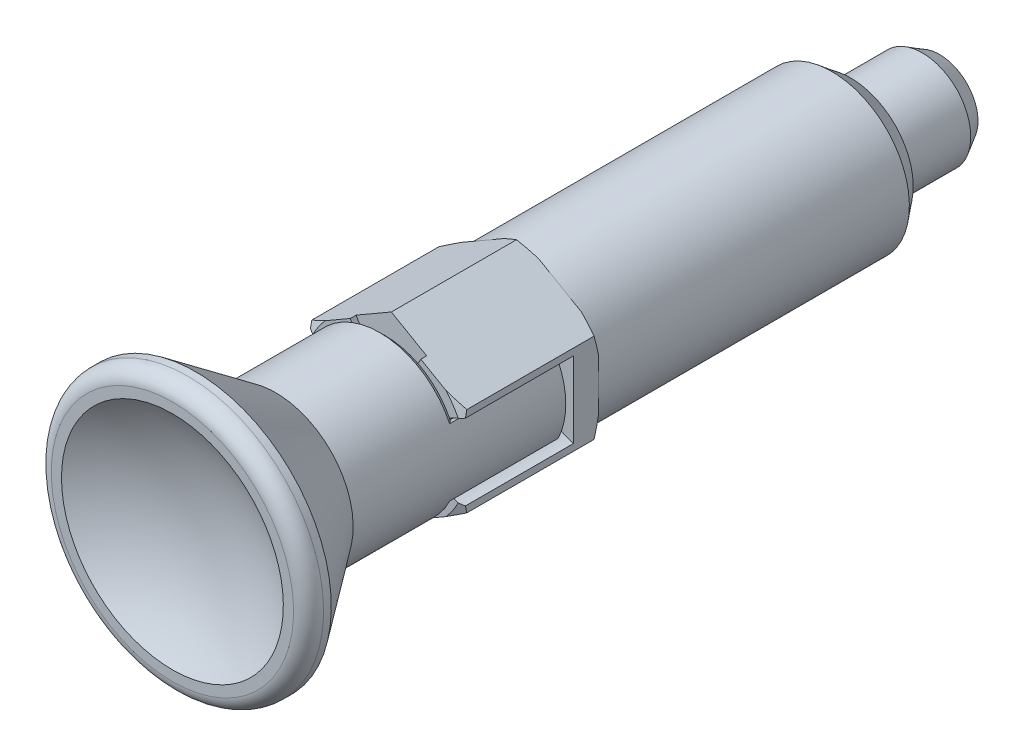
ISO-10303-21;
HEADER;
FILE_DESCRIPTION(('STEP AP214'),'2;1');
FILE_NAME('part.step','',(''),(''),'','','');
FILE_SCHEMA(('AUTOMOTIVE_DESIGN { 1 0 10303 214 1 1 1 1 }'));
ENDSEC;
DATA;
#1=APPLICATION_CONTEXT('core data for automotive mechanical design processes');
#2=APPLICATION_PROTOCOL_DEFINITION('international standard','automotive_design',2000,#1);
#3=PRODUCT_CONTEXT('',#1,'mechanical');
#4=PRODUCT('Part','Part','',(#3));
#5=PRODUCT_RELATED_PRODUCT_CATEGORY('part','',(#4));
#6=PRODUCT_DEFINITION_FORMATION('','',#4);
#7=PRODUCT_DEFINITION_CONTEXT('part definition',#1,'design');
#8=PRODUCT_DEFINITION('design','',#6,#7);
#9=PRODUCT_DEFINITION_SHAPE('','',#8);
#10=(LENGTH_UNIT() NAMED_UNIT(*) SI_UNIT(.MILLI.,.METRE.));
#11=(NAMED_UNIT(*) PLANE_ANGLE_UNIT() SI_UNIT($,.RADIAN.));
#12=(NAMED_UNIT(*) SI_UNIT($,.STERADIAN.) SOLID_ANGLE_UNIT());
#13=UNCERTAINTY_MEASURE_WITH_UNIT(LENGTH_MEASURE(1.E-05),#10,'distance_accuracy_value','');
#14=(GEOMETRIC_REPRESENTATION_CONTEXT(3) GLOBAL_UNCERTAINTY_ASSIGNED_CONTEXT((#13)) GLOBAL_UNIT_ASSIGNED_CONTEXT((#10,
#11,#12)) REPRESENTATION_CONTEXT('',''));
#15=CARTESIAN_POINT('',(0.,0.,0.));
#16=DIRECTION('',(0.,0.,1.));
#17=DIRECTION('',(1.,0.,0.));
#18=AXIS2_PLACEMENT_3D('',#15,#16,#17);
#19=CARTESIAN_POINT('',(0.,0.,0.243246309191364));
#20=DIRECTION('',(0.,0.,1.));
#21=DIRECTION('',(0.,-1.,0.));
#22=AXIS2_PLACEMENT_3D('',#19,#20,#21);
#23=CONICAL_SURFACE('',#22,4.62131496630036,1.04719755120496);
#24=CARTESIAN_POINT('',(3.10905365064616,2.82378919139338,-1.11854969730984E-11));
#25=CARTESIAN_POINT('',(3.18423736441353,2.78038185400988,0.0152814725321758));
#26=CARTESIAN_POINT('',(3.25920650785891,2.73709839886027,0.0319318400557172));
#27=CARTESIAN_POINT('',(3.40864095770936,2.65082237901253,0.0677326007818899));
#28=CARTESIAN_POINT('',(3.4831065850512,2.60782962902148,0.0868812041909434));
#29=CARTESIAN_POINT('',(3.63155907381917,2.52212054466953,0.127461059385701));
#30=CARTESIAN_POINT('',(3.70554598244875,2.47940418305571,0.148892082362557));
#31=CARTESIAN_POINT('',(3.85310087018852,2.39421332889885,0.193837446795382));
#32=CARTESIAN_POINT('',(3.926668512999,2.35173903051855,0.217353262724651));
#33=CARTESIAN_POINT('',(3.99999992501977,2.30940112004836,0.241795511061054));
#34=B_SPLINE_CURVE_WITH_KNOTS('',3,(#24,#25,#26,#27,#28,#29,#30,#31,#32,#33),.UNSPECIFIED.,.F.,
.F.,(4,2,2,2,4),(0.,0.26442754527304,0.528666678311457,0.792879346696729,1.05728039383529),.UNSPECIFIED.);
#35=CARTESIAN_POINT('',(3.10905365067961,2.82378919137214,-3.20837106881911E-12));
#36=VERTEX_POINT('',#35);
#37=CARTESIAN_POINT('',(4.,2.30940109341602,0.241795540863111));
#38=VERTEX_POINT('',#37);
#39=EDGE_CURVE('E249',#36,#38,#34,.T.);
#40=ORIENTED_EDGE('',*,*,#39,.T.);
#41=CARTESIAN_POINT('',(4.,2.30940111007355,0.241795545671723));
#42=CARTESIAN_POINT('',(4.,2.22472527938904,0.217353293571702));
#43=CARTESIAN_POINT('',(4.,2.13977667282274,0.19383747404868));
#44=CARTESIAN_POINT('',(4.,1.96939494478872,0.148892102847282));
#45=CARTESIAN_POINT('',(4.,1.88396221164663,0.127461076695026));
#46=CARTESIAN_POINT('',(4.,1.71254402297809,0.0868812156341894));
#47=CARTESIAN_POINT('',(4.,1.62655851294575,0.0677326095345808));
#48=CARTESIAN_POINT('',(4.,1.45400645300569,0.0319318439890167));
#49=CARTESIAN_POINT('',(4.,1.36743953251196,0.0152814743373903));
#50=CARTESIAN_POINT('',(4.,1.28062484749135,-1.02270622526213E-11));
#51=B_SPLINE_CURVE_WITH_KNOTS('',3,(#41,#42,#43,#44,#45,#46,#47,#48,#49,#50),.UNSPECIFIED.,.F.,
.F.,(4,2,2,2,4),(0.,0.264401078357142,0.528613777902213,0.792852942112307,1.05728051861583),.UNSPECIFIED.);
#52=CARTESIAN_POINT('',(4.,1.28062484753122,-3.20837106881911E-12));
#53=VERTEX_POINT('',#52);
#54=EDGE_CURVE('E260',#38,#53,#51,.T.);
#55=ORIENTED_EDGE('',*,*,#54,.T.);
#56=CARTESIAN_POINT('',(0.,0.,3.79123815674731E-12));
#57=DIRECTION('',(0.,0.,1.));
#58=DIRECTION('',(0.,-1.,0.));
#59=AXIS2_PLACEMENT_3D('',#56,#57,#58);
#60=CIRCLE('',#59,4.20000000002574);
#61=EDGE_CURVE('E264',#36,#53,#60,.F.);
#62=ORIENTED_EDGE('',*,*,#61,.F.);
#63=EDGE_LOOP('',(#40,#55,#62));
#64=FACE_BOUND('',#63,.T.);
#65=ADVANCED_FACE('F14',(#64),#23,.T.);
#66=CARTESIAN_POINT('',(0.,0.,0.243246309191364));
#67=DIRECTION('',(0.,0.,1.));
#68=DIRECTION('',(0.,-1.,0.));
#69=AXIS2_PLACEMENT_3D('',#66,#67,#68);
#70=CONICAL_SURFACE('',#69,4.62131496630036,1.04719755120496);
#71=CARTESIAN_POINT('',(4.00000000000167,-1.28062484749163,-1.11854969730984E-11));
#72=CARTESIAN_POINT('',(4.0000000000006,-1.3674395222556,0.0152814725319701));
#73=CARTESIAN_POINT('',(4.00000000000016,-1.4540064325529,0.0319318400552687));
#74=CARTESIAN_POINT('',(3.99999999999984,-1.62655847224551,0.0677326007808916));
#75=CARTESIAN_POINT('',(3.99999999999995,-1.71254397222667,0.0868812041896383));
#76=CARTESIAN_POINT('',(4.00000000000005,-1.88396214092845,0.127461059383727));
#77=CARTESIAN_POINT('',(4.00000000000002,-1.96939486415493,0.148892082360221));
#78=CARTESIAN_POINT('',(3.99999999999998,-2.13977657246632,0.193837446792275));
#79=CARTESIAN_POINT('',(3.99999999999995,-2.22472516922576,0.217353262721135));
#80=CARTESIAN_POINT('',(4.,-2.30940099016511,0.241795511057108));
#81=B_SPLINE_CURVE_WITH_KNOTS('',3,(#71,#72,#73,#74,#75,#76,#77,#78,#79,#80),.UNSPECIFIED.,.F.,
.F.,(4,2,2,2,4),(0.,0.264427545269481,0.528666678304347,0.792879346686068,1.05728039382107),.UNSPECIFIED.);
#82=CARTESIAN_POINT('',(4.,-1.28062484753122,-3.20837106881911E-12));
#83=VERTEX_POINT('',#82);
#84=CARTESIAN_POINT('',(4.00000001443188,-2.30940106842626,0.241795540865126));
#85=VERTEX_POINT('',#84);
#86=EDGE_CURVE('E970',#83,#85,#81,.T.);
#87=ORIENTED_EDGE('',*,*,#86,.T.);
#88=CARTESIAN_POINT('',(4.00000002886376,-2.30940106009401,0.241795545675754));
#89=CARTESIAN_POINT('',(3.92666860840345,-2.35173897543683,0.217353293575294));
#90=CARTESIAN_POINT('',(3.85310095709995,-2.39421327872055,0.193837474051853));
#91=CARTESIAN_POINT('',(3.70554605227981,-2.47940414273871,0.148892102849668));
#92=CARTESIAN_POINT('',(3.63155913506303,-2.52212050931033,0.127461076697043));
#93=CARTESIAN_POINT('',(3.48310662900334,-2.60782960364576,0.086881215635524));
#94=CARTESIAN_POINT('',(3.40864099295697,-2.65082235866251,0.0677326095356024));
#95=CARTESIAN_POINT('',(3.2592065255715,-2.73709838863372,0.0319318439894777));
#96=CARTESIAN_POINT('',(3.18423737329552,-2.78038184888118,0.0152814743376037));
#97=CARTESIAN_POINT('',(3.10905365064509,-2.82378919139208,-1.02235928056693E-11));
#98=B_SPLINE_CURVE_WITH_KNOTS('',3,(#88,#89,#90,#91,#92,#93,#94,#95,#96,#97),.UNSPECIFIED.,.F.,
.F.,(4,2,2,2,4),(0.,0.264401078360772,0.528613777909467,0.792852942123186,1.05728051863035),.UNSPECIFIED.);
#99=CARTESIAN_POINT('',(3.10905365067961,-2.82378919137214,-3.20663634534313E-12));
#100=VERTEX_POINT('',#99);
#101=EDGE_CURVE('E964',#85,#100,#98,.T.);
#102=ORIENTED_EDGE('',*,*,#101,.T.);
#103=CARTESIAN_POINT('',(0.,0.,3.79123815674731E-12));
#104=DIRECTION('',(0.,0.,1.));
#105=DIRECTION('',(0.,-1.,0.));
#106=AXIS2_PLACEMENT_3D('',#103,#104,#105);
#107=CIRCLE('',#106,4.20000000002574);
#108=EDGE_CURVE('E874',#83,#100,#107,.F.);
#109=ORIENTED_EDGE('',*,*,#108,.F.);
#110=EDGE_LOOP('',(#87,#102,#109));
#111=FACE_BOUND('',#110,.T.);
#112=ADVANCED_FACE('F976',(#111),#70,.T.);
#113=CARTESIAN_POINT('',(0.,0.,0.243246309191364));
#114=DIRECTION('',(0.,0.,1.));
#115=DIRECTION('',(0.,-1.,0.));
#116=AXIS2_PLACEMENT_3D('',#113,#114,#115);
#117=CONICAL_SURFACE('',#116,4.62131496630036,1.04719755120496);
#118=CARTESIAN_POINT('',(-4.,-2.3094011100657,0.241795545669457));
#119=CARTESIAN_POINT('',(-4.,-2.22472527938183,0.217353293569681));
#120=CARTESIAN_POINT('',(-4.,-2.13977667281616,0.193837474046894));
#121=CARTESIAN_POINT('',(-4.,-1.96939494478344,0.14889210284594));
#122=CARTESIAN_POINT('',(-4.,-1.883962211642,0.127461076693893));
#123=CARTESIAN_POINT('',(-4.,-1.71254402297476,0.0868812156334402));
#124=CARTESIAN_POINT('',(-4.,-1.62655851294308,0.0677326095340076));
#125=CARTESIAN_POINT('',(-4.,-1.45400645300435,0.0319318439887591));
#126=CARTESIAN_POINT('',(-4.,-1.36743953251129,0.015281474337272));
#127=CARTESIAN_POINT('',(-4.,-1.28062484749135,-1.02270622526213E-11));
#128=B_SPLINE_CURVE_WITH_KNOTS('',3,(#118,#119,#120,#121,#122,#123,#124,#125,#126,#127),
.UNSPECIFIED.,.F.,.F.,(4,2,2,2,4),(0.,0.264401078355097,0.528613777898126,0.792852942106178,
1.05728051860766),.UNSPECIFIED.);
#129=CARTESIAN_POINT('',(-4.,-2.3094010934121,0.241795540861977));
#130=VERTEX_POINT('',#129);
#131=CARTESIAN_POINT('',(-4.,-1.28062484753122,-3.20837106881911E-12));
#132=VERTEX_POINT('',#131);
#133=EDGE_CURVE('E733',#130,#132,#128,.T.);
#134=ORIENTED_EDGE('',*,*,#133,.T.);
#135=CARTESIAN_POINT('',(0.,0.,3.79123815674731E-12));
#136=DIRECTION('',(0.,0.,1.));
#137=DIRECTION('',(0.,-1.,0.));
#138=AXIS2_PLACEMENT_3D('',#135,#136,#137);
#139=CIRCLE('',#138,4.20000000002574);
#140=CARTESIAN_POINT('',(-3.10905365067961,-2.82378919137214,-3.20837106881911E-12));
#141=VERTEX_POINT('',#140);
#142=EDGE_CURVE('E872',#141,#132,#139,.F.);
#143=ORIENTED_EDGE('',*,*,#142,.F.);
#144=CARTESIAN_POINT('',(-3.10905365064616,-2.82378919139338,-1.11854969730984E-11));
#145=CARTESIAN_POINT('',(-3.18423736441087,-2.78038185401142,0.0152814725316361));
#146=CARTESIAN_POINT('',(-3.25920650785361,-2.73709839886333,0.0319318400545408));
#147=CARTESIAN_POINT('',(-3.40864095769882,-2.65082237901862,0.0677326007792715));
#148=CARTESIAN_POINT('',(-3.48310658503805,-2.60782962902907,0.0868812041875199));
#149=CARTESIAN_POINT('',(-3.63155907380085,-2.52212054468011,0.127461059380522));
#150=CARTESIAN_POINT('',(-3.70554598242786,-2.47940418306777,0.148892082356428));
#151=CARTESIAN_POINT('',(-3.85310087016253,-2.39421332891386,0.193837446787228));
#152=CARTESIAN_POINT('',(-3.92666851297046,-2.35173903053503,0.217353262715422));
#153=CARTESIAN_POINT('',(-3.9999999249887,-2.30940112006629,0.241795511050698));
#154=B_SPLINE_CURVE_WITH_KNOTS('',3,(#144,#145,#146,#147,#148,#149,#150,#151,#152,#153),
.UNSPECIFIED.,.F.,.F.,(4,2,2,2,4),(0.,0.264427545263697,0.528666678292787,0.792879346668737,
1.05728039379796),.UNSPECIFIED.);
#155=EDGE_CURVE('E912',#141,#130,#154,.T.);
#156=ORIENTED_EDGE('',*,*,#155,.T.);
#157=EDGE_LOOP('',(#134,#143,#156));
#158=FACE_BOUND('',#157,.T.);
#159=ADVANCED_FACE('F714',(#158),#117,.T.);
#160=CARTESIAN_POINT('',(0.,0.,0.243246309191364));
#161=DIRECTION('',(0.,0.,1.));
#162=DIRECTION('',(0.,-1.,0.));
#163=AXIS2_PLACEMENT_3D('',#160,#161,#162);
#164=CONICAL_SURFACE('',#163,4.62131496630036,1.04719755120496);
#165=CARTESIAN_POINT('',(-4.00000000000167,1.28062484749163,-1.11846296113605E-11));
#166=CARTESIAN_POINT('',(-4.0000000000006,1.3674395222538,0.0152814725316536));
#167=CARTESIAN_POINT('',(-4.00000000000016,1.45400643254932,0.0319318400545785));
#168=CARTESIAN_POINT('',(-3.99999999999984,1.62655847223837,0.0677326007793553));
#169=CARTESIAN_POINT('',(-3.99999999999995,1.71254397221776,0.0868812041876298));
#170=CARTESIAN_POINT('',(-4.00000000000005,1.88396214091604,0.127461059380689));
#171=CARTESIAN_POINT('',(-4.00000000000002,1.96939486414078,0.148892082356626));
#172=CARTESIAN_POINT('',(-3.99999999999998,2.13977657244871,0.193837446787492));
#173=CARTESIAN_POINT('',(-3.99999999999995,2.22472516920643,0.217353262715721));
#174=CARTESIAN_POINT('',(-4.,2.30940099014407,0.241795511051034));
#175=B_SPLINE_CURVE_WITH_KNOTS('',3,(#165,#166,#167,#168,#169,#170,#171,#172,#173,#174),
.UNSPECIFIED.,.F.,.F.,(4,2,2,2,4),(0.,0.264427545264,0.528666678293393,0.792879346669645,
1.05728039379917),.UNSPECIFIED.);
#176=CARTESIAN_POINT('',(-4.,1.28062484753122,-3.20837106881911E-12));
#177=VERTEX_POINT('',#176);
#178=CARTESIAN_POINT('',(-4.00000001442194,2.309401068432,0.241795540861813));
#179=VERTEX_POINT('',#178);
#180=EDGE_CURVE('E725',#177,#179,#175,.T.);
#181=ORIENTED_EDGE('',*,*,#180,.T.);
#182=CARTESIAN_POINT('',(-4.00000002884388,2.30940106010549,0.241795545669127));
#183=CARTESIAN_POINT('',(-3.92666860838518,2.35173897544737,0.217353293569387));
#184=CARTESIAN_POINT('',(-3.85310095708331,2.39421327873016,0.193837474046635));
#185=CARTESIAN_POINT('',(-3.70554605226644,2.47940414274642,0.148892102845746));
#186=CARTESIAN_POINT('',(-3.6315591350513,2.5221205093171,0.127461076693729));
#187=CARTESIAN_POINT('',(-3.48310662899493,2.60782960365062,0.0868812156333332));
#188=CARTESIAN_POINT('',(-3.40864099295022,2.65082235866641,0.0677326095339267));
#189=CARTESIAN_POINT('',(-3.25920652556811,2.73709838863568,0.0319318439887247));
#190=CARTESIAN_POINT('',(-3.18423737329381,2.78038184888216,0.0152814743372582));
#191=CARTESIAN_POINT('',(-3.10905365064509,2.82378919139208,-1.02235928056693E-11));
#192=B_SPLINE_CURVE_WITH_KNOTS('',3,(#182,#183,#184,#185,#186,#187,#188,#189,#190,#191),
.UNSPECIFIED.,.F.,.F.,(4,2,2,2,4),(0.,0.264401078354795,0.528613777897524,0.792852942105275,
1.05728051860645),.UNSPECIFIED.);
#193=CARTESIAN_POINT('',(-3.10905365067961,2.82378919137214,-3.20663634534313E-12));
#194=VERTEX_POINT('',#193);
#195=EDGE_CURVE('E719',#179,#194,#192,.T.);
#196=ORIENTED_EDGE('',*,*,#195,.T.);
#197=CARTESIAN_POINT('',(0.,0.,3.79123815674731E-12));
#198=DIRECTION('',(0.,0.,1.));
#199=DIRECTION('',(0.,-1.,0.));
#200=AXIS2_PLACEMENT_3D('',#197,#198,#199);
#201=CIRCLE('',#200,4.20000000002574);
#202=EDGE_CURVE('E862',#177,#194,#201,.F.);
#203=ORIENTED_EDGE('',*,*,#202,.F.);
#204=EDGE_LOOP('',(#181,#196,#203));
#205=FACE_BOUND('',#204,.T.);
#206=ADVANCED_FACE('F707',(#205),#164,.T.);
#207=CARTESIAN_POINT('',(0.,0.,0.243246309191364));
#208=DIRECTION('',(0.,0.,1.));
#209=DIRECTION('',(0.,-1.,0.));
#210=AXIS2_PLACEMENT_3D('',#207,#208,#209);
#211=CONICAL_SURFACE('',#210,4.62131496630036,1.04719755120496);
#212=CARTESIAN_POINT('',(-0.890946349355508,4.10441403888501,-1.11811601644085E-11));
#213=CARTESIAN_POINT('',(-0.815762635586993,4.14782137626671,0.0152814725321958));
#214=CARTESIAN_POINT('',(-0.740793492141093,4.19110483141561,0.0319318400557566));
#215=CARTESIAN_POINT('',(-0.591359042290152,4.27738085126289,0.0677326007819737));
#216=CARTESIAN_POINT('',(-0.51689341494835,4.32037360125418,0.0868812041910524));
#217=CARTESIAN_POINT('',(-0.368440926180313,4.40608268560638,0.127461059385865));
#218=CARTESIAN_POINT('',(-0.294454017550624,4.44879904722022,0.14889208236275));
#219=CARTESIAN_POINT('',(-0.146899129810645,4.53398990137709,0.193837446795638));
#220=CARTESIAN_POINT('',(-0.0733314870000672,4.57646419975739,0.217353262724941));
#221=CARTESIAN_POINT('',(-7.49792704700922E-08,4.61880211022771,0.241795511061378));
#222=B_SPLINE_CURVE_WITH_KNOTS('',3,(#212,#213,#214,#215,#216,#217,#218,#219,#220,#221),
.UNSPECIFIED.,.F.,.F.,(4,2,2,2,4),(0.,0.264427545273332,0.52866667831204,0.792879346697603,
1.05728039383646),.UNSPECIFIED.);
#223=CARTESIAN_POINT('',(-0.890946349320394,4.10441403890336,-3.20663634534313E-12));
#224=VERTEX_POINT('',#223);
#225=CARTESIAN_POINT('',(-1.44253481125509E-08,4.61880216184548,0.241795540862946));
#226=VERTEX_POINT('',#225);
#227=EDGE_CURVE('E277',#224,#226,#222,.T.);
#228=ORIENTED_EDGE('',*,*,#227,.T.);
#229=CARTESIAN_POINT('',(-2.88506918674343E-08,4.61880217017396,0.241795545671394));
#230=CARTESIAN_POINT('',(0.07333139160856,4.57646425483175,0.217353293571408));
#231=CARTESIAN_POINT('',(0.146899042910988,4.53398995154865,0.19383747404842));
#232=CARTESIAN_POINT('',(0.294453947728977,4.44879908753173,0.148892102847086));
#233=CARTESIAN_POINT('',(0.368440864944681,4.40608272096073,0.127461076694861));
#234=CARTESIAN_POINT('',(0.516893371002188,4.32037362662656,0.0868812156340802));
#235=CARTESIAN_POINT('',(0.59135900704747,4.27738087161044,0.0677326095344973));
#236=CARTESIAN_POINT('',(0.740793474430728,4.1911048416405,0.031931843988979));
#237=CARTESIAN_POINT('',(0.815762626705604,4.14782138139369,0.0152814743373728));
#238=CARTESIAN_POINT('',(0.890946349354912,4.10441403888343,-1.02279296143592E-11));
#239=B_SPLINE_CURVE_WITH_KNOTS('',3,(#229,#230,#231,#232,#233,#234,#235,#236,#237,#238),
.UNSPECIFIED.,.F.,.F.,(4,2,2,2,4),(0.,0.264401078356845,0.528613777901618,0.792852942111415,
1.05728051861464),.UNSPECIFIED.);
#240=CARTESIAN_POINT('',(0.890946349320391,4.10441403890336,-3.2092384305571E-12));
#241=VERTEX_POINT('',#240);
#242=EDGE_CURVE('E275',#226,#241,#239,.T.);
#243=ORIENTED_EDGE('',*,*,#242,.T.);
#244=CARTESIAN_POINT('',(0.,0.,3.79123815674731E-12));
#245=DIRECTION('',(0.,0.,1.));
#246=DIRECTION('',(0.,-1.,0.));
#247=AXIS2_PLACEMENT_3D('',#244,#245,#246);
#248=CIRCLE('',#247,4.20000000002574);
#249=EDGE_CURVE('E855',#224,#241,#248,.F.);
#250=ORIENTED_EDGE('',*,*,#249,.F.);
#251=EDGE_LOOP('',(#228,#243,#250));
#252=FACE_BOUND('',#251,.T.);
#253=ADVANCED_FACE('F702',(#252),#211,.T.);
#254=CARTESIAN_POINT('',(4.,0.,0.));
#255=DIRECTION('',(0.,0.,-1.));
#256=DIRECTION('',(0.,1.,0.));
#257=AXIS2_PLACEMENT_3D('',#254,#255,#256);
#258=PLANE('',#257);
#259=ORIENTED_EDGE('',*,*,#61,.T.);
#260=DIRECTION('',(0.,1.,0.));
#261=VECTOR('',#260,1.);
#262=CARTESIAN_POINT('',(4.,0.,0.));
#263=LINE('',#262,#261);
#264=CARTESIAN_POINT('',(4.,0.,0.));
#265=VERTEX_POINT('',#264);
#266=EDGE_CURVE('E269',#53,#265,#263,.F.);
#267=ORIENTED_EDGE('',*,*,#266,.T.);
#268=CARTESIAN_POINT('',(0.,0.,0.));
#269=DIRECTION('',(0.,0.,1.));
#270=DIRECTION('',(0.,-1.,0.));
#271=AXIS2_PLACEMENT_3D('',#268,#269,#270);
#272=CIRCLE('',#271,4.);
#273=CARTESIAN_POINT('',(2.,3.46410161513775,0.));
#274=VERTEX_POINT('',#273);
#275=EDGE_CURVE('E273',#274,#265,#272,.F.);
#276=ORIENTED_EDGE('',*,*,#275,.F.);
#277=DIRECTION('',(0.86602540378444,-0.5,0.));
#278=VECTOR('',#277,1.);
#279=CARTESIAN_POINT('',(2.,3.46410161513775,0.));
#280=LINE('',#279,#278);
#281=EDGE_CURVE('E255',#274,#36,#280,.T.);
#282=ORIENTED_EDGE('',*,*,#281,.T.);
#283=EDGE_LOOP('',(#259,#267,#276,#282));
#284=FACE_BOUND('',#283,.T.);
#285=ADVANCED_FACE('F271',(#284),#258,.T.);
#286=CARTESIAN_POINT('',(4.,0.,0.));
#287=DIRECTION('',(0.,0.,-1.));
#288=DIRECTION('',(0.,1.,0.));
#289=AXIS2_PLACEMENT_3D('',#286,#287,#288);
#290=PLANE('',#289);
#291=ORIENTED_EDGE('',*,*,#108,.T.);
#292=DIRECTION('',(-0.866025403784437,-0.5,0.));
#293=VECTOR('',#292,1.);
#294=CARTESIAN_POINT('',(3.10905365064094,-2.82378919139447,0.));
#295=LINE('',#294,#293);
#296=CARTESIAN_POINT('',(2.,-3.46410161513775,0.));
#297=VERTEX_POINT('',#296);
#298=EDGE_CURVE('E873',#100,#297,#295,.T.);
#299=ORIENTED_EDGE('',*,*,#298,.T.);
#300=CARTESIAN_POINT('',(0.,0.,0.));
#301=DIRECTION('',(0.,0.,1.));
#302=DIRECTION('',(0.,-1.,0.));
#303=AXIS2_PLACEMENT_3D('',#300,#301,#302);
#304=CIRCLE('',#303,4.);
#305=EDGE_CURVE('E882',#265,#297,#304,.F.);
#306=ORIENTED_EDGE('',*,*,#305,.F.);
#307=DIRECTION('',(0.,1.,0.));
#308=VECTOR('',#307,1.);
#309=CARTESIAN_POINT('',(4.,0.,0.));
#310=LINE('',#309,#308);
#311=EDGE_CURVE('E875',#265,#83,#310,.F.);
#312=ORIENTED_EDGE('',*,*,#311,.T.);
#313=EDGE_LOOP('',(#291,#299,#306,#312));
#314=FACE_BOUND('',#313,.T.);
#315=ADVANCED_FACE('F883',(#314),#290,.T.);
#316=CARTESIAN_POINT('',(4.,0.,0.));
#317=DIRECTION('',(0.,0.,-1.));
#318=DIRECTION('',(0.,1.,0.));
#319=AXIS2_PLACEMENT_3D('',#316,#317,#318);
#320=PLANE('',#319);
#321=CARTESIAN_POINT('',(0.,0.,0.));
#322=DIRECTION('',(0.,0.,1.));
#323=DIRECTION('',(0.,-1.,0.));
#324=AXIS2_PLACEMENT_3D('',#321,#322,#323);
#325=CIRCLE('',#324,4.);
#326=CARTESIAN_POINT('',(-2.,-3.46410161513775,0.));
#327=VERTEX_POINT('',#326);
#328=CARTESIAN_POINT('',(-4.,0.,0.));
#329=VERTEX_POINT('',#328);
#330=EDGE_CURVE('E888',#327,#329,#325,.F.);
#331=ORIENTED_EDGE('',*,*,#330,.F.);
#332=DIRECTION('',(-0.86602540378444,0.5,0.));
#333=VECTOR('',#332,1.);
#334=CARTESIAN_POINT('',(-2.,-3.46410161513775,0.));
#335=LINE('',#334,#333);
#336=EDGE_CURVE('E866',#327,#141,#335,.T.);
#337=ORIENTED_EDGE('',*,*,#336,.T.);
#338=ORIENTED_EDGE('',*,*,#142,.T.);
#339=DIRECTION('',(0.,1.,0.));
#340=VECTOR('',#339,1.);
#341=CARTESIAN_POINT('',(-4.,0.,0.));
#342=LINE('',#341,#340);
#343=EDGE_CURVE('E869',#132,#329,#342,.T.);
#344=ORIENTED_EDGE('',*,*,#343,.T.);
#345=EDGE_LOOP('',(#331,#337,#338,#344));
#346=FACE_BOUND('',#345,.T.);
#347=ADVANCED_FACE('F907',(#346),#320,.T.);
#348=CARTESIAN_POINT('',(4.,0.,0.));
#349=DIRECTION('',(0.,0.,-1.));
#350=DIRECTION('',(0.,1.,0.));
#351=AXIS2_PLACEMENT_3D('',#348,#349,#350);
#352=PLANE('',#351);
#353=ORIENTED_EDGE('',*,*,#202,.T.);
#354=DIRECTION('',(0.866025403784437,0.5,0.));
#355=VECTOR('',#354,1.);
#356=CARTESIAN_POINT('',(-3.10905365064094,2.82378919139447,0.));
#357=LINE('',#356,#355);
#358=CARTESIAN_POINT('',(-2.,3.46410161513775,0.));
#359=VERTEX_POINT('',#358);
#360=EDGE_CURVE('E859',#194,#359,#357,.T.);
#361=ORIENTED_EDGE('',*,*,#360,.T.);
#362=CARTESIAN_POINT('',(0.,0.,0.));
#363=DIRECTION('',(0.,0.,1.));
#364=DIRECTION('',(0.,-1.,0.));
#365=AXIS2_PLACEMENT_3D('',#362,#363,#364);
#366=CIRCLE('',#365,4.);
#367=EDGE_CURVE('E917',#329,#359,#366,.F.);
#368=ORIENTED_EDGE('',*,*,#367,.F.);
#369=DIRECTION('',(0.,1.,0.));
#370=VECTOR('',#369,1.);
#371=CARTESIAN_POINT('',(-4.,0.,0.));
#372=LINE('',#371,#370);
#373=EDGE_CURVE('E863',#329,#177,#372,.T.);
#374=ORIENTED_EDGE('',*,*,#373,.T.);
#375=EDGE_LOOP('',(#353,#361,#368,#374));
#376=FACE_BOUND('',#375,.T.);
#377=ADVANCED_FACE('F916',(#376),#352,.T.);
#378=CARTESIAN_POINT('',(4.,0.,0.));
#379=DIRECTION('',(0.,0.,-1.));
#380=DIRECTION('',(0.,1.,0.));
#381=AXIS2_PLACEMENT_3D('',#378,#379,#380);
#382=PLANE('',#381);
#383=ORIENTED_EDGE('',*,*,#249,.T.);
#384=DIRECTION('',(0.866025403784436,-0.5,0.));
#385=VECTOR('',#384,1.);
#386=CARTESIAN_POINT('',(0.890946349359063,4.10441403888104,0.));
#387=LINE('',#386,#385);
#388=EDGE_CURVE('E853',#241,#274,#387,.T.);
#389=ORIENTED_EDGE('',*,*,#388,.T.);
#390=CARTESIAN_POINT('',(0.,0.,0.));
#391=DIRECTION('',(0.,0.,1.));
#392=DIRECTION('',(0.,-1.,0.));
#393=AXIS2_PLACEMENT_3D('',#390,#391,#392);
#394=CIRCLE('',#393,4.);
#395=EDGE_CURVE('E895',#359,#274,#394,.F.);
#396=ORIENTED_EDGE('',*,*,#395,.F.);
#397=DIRECTION('',(0.86602540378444,0.5,0.));
#398=VECTOR('',#397,1.);
#399=CARTESIAN_POINT('',(-2.,3.46410161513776,0.));
#400=LINE('',#399,#398);
#401=EDGE_CURVE('E856',#359,#224,#400,.T.);
#402=ORIENTED_EDGE('',*,*,#401,.T.);
#403=EDGE_LOOP('',(#383,#389,#396,#402));
#404=FACE_BOUND('',#403,.T.);
#405=ADVANCED_FACE('F1030',(#404),#382,.T.);
#406=CARTESIAN_POINT('',(0.,0.,-17.));
#407=DIRECTION('',(0.,0.,1.));
#408=DIRECTION('',(0.,-1.,0.));
#409=AXIS2_PLACEMENT_3D('',#406,#407,#408);
#410=CYLINDRICAL_SURFACE('',#409,4.);
#411=ORIENTED_EDGE('',*,*,#367,.T.);
#412=ORIENTED_EDGE('',*,*,#395,.T.);
#413=ORIENTED_EDGE('',*,*,#275,.T.);
#414=ORIENTED_EDGE('',*,*,#305,.T.);
#415=CARTESIAN_POINT('',(0.,0.,0.));
#416=DIRECTION('',(0.,0.,1.));
#417=DIRECTION('',(0.,-1.,0.));
#418=AXIS2_PLACEMENT_3D('',#415,#416,#417);
#419=CIRCLE('',#418,4.);
#420=EDGE_CURVE('E852',#327,#297,#419,.T.);
#421=ORIENTED_EDGE('',*,*,#420,.F.);
#422=ORIENTED_EDGE('',*,*,#330,.T.);
#423=EDGE_LOOP('',(#411,#412,#413,#414,#421,#422));
#424=FACE_BOUND('',#423,.T.);
#425=CARTESIAN_POINT('',(0.,0.,-16.033));
#426=DIRECTION('',(0.,0.,1.));
#427=DIRECTION('',(0.,-1.,0.));
#428=AXIS2_PLACEMENT_3D('',#425,#426,#427);
#429=CIRCLE('',#428,4.);
#430=CARTESIAN_POINT('',(0.,-4.,-16.033));
#431=VERTEX_POINT('',#430);
#432=EDGE_CURVE('E261',#431,#431,#429,.T.);
#433=ORIENTED_EDGE('',*,*,#432,.T.);
#434=EDGE_LOOP('',(#433));
#435=FACE_BOUND('',#434,.T.);
#436=ADVANCED_FACE('F892',(#424,#435),#410,.T.);
#437=CARTESIAN_POINT('',(4.,0.,0.));
#438=DIRECTION('',(0.,0.,-1.));
#439=DIRECTION('',(0.,1.,0.));
#440=AXIS2_PLACEMENT_3D('',#437,#438,#439);
#441=PLANE('',#440);
#442=CARTESIAN_POINT('',(0.,0.,3.79123815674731E-12));
#443=DIRECTION('',(0.,0.,1.));
#444=DIRECTION('',(0.,-1.,0.));
#445=AXIS2_PLACEMENT_3D('',#442,#443,#444);
#446=CIRCLE('',#445,4.20000000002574);
#447=CARTESIAN_POINT('',(-0.890946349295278,-4.10441403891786,1.89518539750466E-12));
#448=VERTEX_POINT('',#447);
#449=CARTESIAN_POINT('',(0.890946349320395,-4.10441403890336,-3.20663634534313E-12));
#450=VERTEX_POINT('',#449);
#451=EDGE_CURVE('E849',#448,#450,#446,.T.);
#452=ORIENTED_EDGE('',*,*,#451,.F.);
#453=DIRECTION('',(-0.866025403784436,0.5,0.));
#454=VECTOR('',#453,1.);
#455=CARTESIAN_POINT('',(-0.890946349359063,-4.10441403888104,0.));
#456=LINE('',#455,#454);
#457=EDGE_CURVE('E846',#448,#327,#456,.T.);
#458=ORIENTED_EDGE('',*,*,#457,.T.);
#459=ORIENTED_EDGE('',*,*,#420,.T.);
#460=DIRECTION('',(-0.86602540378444,-0.5,0.));
#461=VECTOR('',#460,1.);
#462=CARTESIAN_POINT('',(2.,-3.46410161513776,0.));
#463=LINE('',#462,#461);
#464=EDGE_CURVE('E850',#297,#450,#463,.T.);
#465=ORIENTED_EDGE('',*,*,#464,.T.);
#466=EDGE_LOOP('',(#452,#458,#459,#465));
#467=FACE_BOUND('',#466,.T.);
#468=ADVANCED_FACE('F942',(#467),#441,.T.);
#469=CARTESIAN_POINT('',(0.,0.,0.243246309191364));
#470=DIRECTION('',(0.,0.,1.));
#471=DIRECTION('',(0.,-1.,0.));
#472=AXIS2_PLACEMENT_3D('',#469,#470,#471);
#473=CONICAL_SURFACE('',#472,4.62131496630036,1.04719755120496);
#474=CARTESIAN_POINT('',(0.890946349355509,-4.10441403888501,-1.11811601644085E-11));
#475=CARTESIAN_POINT('',(0.815762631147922,-4.14782137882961,0.0152814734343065));
#476=CARTESIAN_POINT('',(0.740793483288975,-4.19110483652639,0.0319318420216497));
#477=CARTESIAN_POINT('',(0.591359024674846,-4.27738086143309,0.0677326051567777));
#478=CARTESIAN_POINT('',(0.516893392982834,-4.32037361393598,0.0868812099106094));
#479=CARTESIAN_POINT('',(0.368440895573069,-4.40608270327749,0.127461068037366));
#480=CARTESIAN_POINT('',(0.294453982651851,-4.44879906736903,0.148892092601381));
#481=CARTESIAN_POINT('',(0.146899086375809,-4.5339899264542,0.193837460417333));
#482=CARTESIAN_POINT('',(0.0733314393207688,-4.57646422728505,0.21735327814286));
#483=CARTESIAN_POINT('',(2.30822100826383E-08,-4.61880214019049,0.241795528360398));
#484=B_SPLINE_CURVE_WITH_KNOTS('',3,(#474,#475,#476,#477,#478,#479,#480,#481,#482,#483),
.UNSPECIFIED.,.F.,.F.,(4,2,2,2,4),(0.,0.264427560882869,0.528666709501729,0.792879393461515,
1.05728045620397),.UNSPECIFIED.);
#485=CARTESIAN_POINT('',(0.,-4.61880214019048,0.241795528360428));
#486=VERTEX_POINT('',#485);
#487=EDGE_CURVE('E843',#450,#486,#484,.T.);
#488=ORIENTED_EDGE('',*,*,#487,.T.);
#489=CARTESIAN_POINT('',(-0.890946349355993,-4.1044140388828,-1.04473721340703E-11));
#490=CARTESIAN_POINT('',(-0.815762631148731,-4.14782137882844,0.0152814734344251));
#491=CARTESIAN_POINT('',(-0.740793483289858,-4.19110483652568,0.0319318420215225));
#492=CARTESIAN_POINT('',(-0.591359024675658,-4.2773808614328,0.0677326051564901));
#493=CARTESIAN_POINT('',(-0.516893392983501,-4.32037361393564,0.0868812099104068));
#494=CARTESIAN_POINT('',(-0.36844089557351,-4.40608270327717,0.127461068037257));
#495=CARTESIAN_POINT('',(-0.294453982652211,-4.44879906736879,0.148892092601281));
#496=CARTESIAN_POINT('',(-0.146899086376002,-4.53398992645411,0.193837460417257));
#497=CARTESIAN_POINT('',(-0.0733314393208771,-4.57646422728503,0.217353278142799));
#498=CARTESIAN_POINT('',(-2.3082205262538E-08,-4.61880214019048,0.241795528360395));
#499=B_SPLINE_CURVE_WITH_KNOTS('',3,(#489,#490,#491,#492,#493,#494,#495,#496,#497,#498),
.UNSPECIFIED.,.F.,.F.,(4,2,2,2,4),(0.,0.264427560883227,0.528666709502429,0.792879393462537,
1.05728045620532),.UNSPECIFIED.);
#500=EDGE_CURVE('E827',#448,#486,#499,.T.);
#501=ORIENTED_EDGE('',*,*,#500,.F.);
#502=ORIENTED_EDGE('',*,*,#451,.T.);
#503=EDGE_LOOP('',(#488,#501,#502));
#504=FACE_BOUND('',#503,.T.);
#505=ADVANCED_FACE('F937',(#504),#473,.T.);
#506=CARTESIAN_POINT('',(0.,4.61880215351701,0.));
#507=DIRECTION('',(-0.5,0.866025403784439,0.));
#508=DIRECTION('',(-0.866025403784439,-0.5,0.));
#509=AXIS2_PLACEMENT_3D('',#506,#507,#508);
#510=PLANE('',#509);
#511=CARTESIAN_POINT('',(-4.,2.30940107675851,6.80470934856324));
#512=CARTESIAN_POINT('',(-3.92636514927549,2.35191417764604,6.82453265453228));
#513=CARTESIAN_POINT('',(-3.85257062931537,2.39451946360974,6.84357960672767));
#514=CARTESIAN_POINT('',(-3.70470086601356,2.47989211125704,6.87994683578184));
#515=CARTESIAN_POINT('',(-3.63062577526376,2.52265938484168,6.89726794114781));
#516=CARTESIAN_POINT('',(-3.48215751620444,2.6083775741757,6.93003003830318));
#517=CARTESIAN_POINT('',(-3.40776432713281,2.65132850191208,6.94547090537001));
#518=CARTESIAN_POINT('',(-3.25864542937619,2.73742233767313,6.9743113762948));
#519=CARTESIAN_POINT('',(-3.1839195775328,2.78056532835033,6.98770999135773));
#520=CARTESIAN_POINT('',(-3.10905365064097,2.82378919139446,7.00000000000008));
#521=B_SPLINE_CURVE_WITH_KNOTS('',3,(#511,#512,#513,#514,#515,#516,#517,#518,#519,#520),
.UNSPECIFIED.,.F.,.F.,(4,2,2,2,4),(0.,0.261920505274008,0.523714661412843,0.785526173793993,
1.04746404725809),.UNSPECIFIED.);
#522=CARTESIAN_POINT('',(-4.,2.3094010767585,6.80470934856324));
#523=VERTEX_POINT('',#522);
#524=CARTESIAN_POINT('',(-3.10905365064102,2.82378919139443,7.));
#525=VERTEX_POINT('',#524);
#526=EDGE_CURVE('E840',#523,#525,#521,.T.);
#527=ORIENTED_EDGE('',*,*,#526,.T.);
#528=DIRECTION('',(-0.866025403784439,-0.5,0.));
#529=VECTOR('',#528,1.);
#530=CARTESIAN_POINT('',(0.,4.61880215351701,7.));
#531=LINE('',#530,#529);
#532=CARTESIAN_POINT('',(-1.81900356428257,3.56859995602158,7.));
#533=VERTEX_POINT('',#532);
#534=EDGE_CURVE('E819',#525,#533,#531,.F.);
#535=ORIENTED_EDGE('',*,*,#534,.T.);
#536=DIRECTION('',(0.,0.,1.));
#537=VECTOR('',#536,1.);
#538=CARTESIAN_POINT('',(-1.81900356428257,3.56859995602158,0.));
#539=LINE('',#538,#537);
#540=CARTESIAN_POINT('',(-1.81900356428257,3.56859995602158,6.7));
#541=VERTEX_POINT('',#540);
#542=EDGE_CURVE('E841',#533,#541,#539,.F.);
#543=ORIENTED_EDGE('',*,*,#542,.T.);
#544=DIRECTION('',(-0.866025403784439,-0.5,0.));
#545=VECTOR('',#544,1.);
#546=CARTESIAN_POINT('',(0.,4.61880215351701,6.7));
#547=LINE('',#546,#545);
#548=CARTESIAN_POINT('',(0.,4.61880215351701,6.7));
#549=VERTEX_POINT('',#548);
#550=EDGE_CURVE('E622',#549,#541,#547,.T.);
#551=ORIENTED_EDGE('',*,*,#550,.F.);
#552=DIRECTION('',(0.,0.,1.));
#553=VECTOR('',#552,1.);
#554=CARTESIAN_POINT('',(0.,4.61880215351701,0.));
#555=LINE('',#554,#553);
#556=EDGE_CURVE('E633',#226,#549,#555,.T.);
#557=ORIENTED_EDGE('',*,*,#556,.F.);
#558=ORIENTED_EDGE('',*,*,#227,.F.);
#559=ORIENTED_EDGE('',*,*,#401,.F.);
#560=ORIENTED_EDGE('',*,*,#360,.F.);
#561=ORIENTED_EDGE('',*,*,#195,.F.);
#562=DIRECTION('',(0.,0.,1.));
#563=VECTOR('',#562,1.);
#564=CARTESIAN_POINT('',(-4.,2.3094010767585,0.));
#565=LINE('',#564,#563);
#566=EDGE_CURVE('E762',#523,#179,#565,.F.);
#567=ORIENTED_EDGE('',*,*,#566,.F.);
#568=EDGE_LOOP('',(#527,#535,#543,#551,#557,#558,#559,#560,#561,#567));
#569=FACE_BOUND('',#568,.T.);
#570=ADVANCED_FACE('F941',(#569),#510,.T.);
#571=CARTESIAN_POINT('',(-4.,-2.3094010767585,0.));
#572=DIRECTION('',(-0.5,-0.866025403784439,0.));
#573=DIRECTION('',(0.866025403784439,-0.5,0.));
#574=AXIS2_PLACEMENT_3D('',#571,#572,#573);
#575=PLANE('',#574);
#576=DIRECTION('',(0.,0.,1.));
#577=VECTOR('',#576,1.);
#578=CARTESIAN_POINT('',(0.,-4.61880215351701,0.));
#579=LINE('',#578,#577);
#580=CARTESIAN_POINT('',(0.,-4.61880215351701,6.7));
#581=VERTEX_POINT('',#580);
#582=EDGE_CURVE('E825',#581,#486,#579,.F.);
#583=ORIENTED_EDGE('',*,*,#582,.F.);
#584=DIRECTION('',(0.866025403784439,-0.5,0.));
#585=VECTOR('',#584,1.);
#586=CARTESIAN_POINT('',(-1.81900356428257,-3.56859995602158,6.7));
#587=LINE('',#586,#585);
#588=CARTESIAN_POINT('',(-1.81900356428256,-3.56859995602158,6.7));
#589=VERTEX_POINT('',#588);
#590=EDGE_CURVE('E753',#589,#581,#587,.T.);
#591=ORIENTED_EDGE('',*,*,#590,.F.);
#592=DIRECTION('',(0.,0.,1.));
#593=VECTOR('',#592,1.);
#594=CARTESIAN_POINT('',(-1.81900356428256,-3.56859995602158,0.));
#595=LINE('',#594,#593);
#596=CARTESIAN_POINT('',(-1.81900356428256,-3.56859995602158,7.));
#597=VERTEX_POINT('',#596);
#598=EDGE_CURVE('E815',#589,#597,#595,.T.);
#599=ORIENTED_EDGE('',*,*,#598,.T.);
#600=DIRECTION('',(0.866025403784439,-0.5,0.));
#601=VECTOR('',#600,1.);
#602=CARTESIAN_POINT('',(-4.,-2.3094010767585,7.));
#603=LINE('',#602,#601);
#604=CARTESIAN_POINT('',(-3.10905365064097,-2.82378919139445,7.));
#605=VERTEX_POINT('',#604);
#606=EDGE_CURVE('E818',#597,#605,#603,.F.);
#607=ORIENTED_EDGE('',*,*,#606,.T.);
#608=CARTESIAN_POINT('',(-3.10905365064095,-2.82378919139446,7.));
#609=CARTESIAN_POINT('',(-3.18391957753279,-2.78056532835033,6.98770999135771));
#610=CARTESIAN_POINT('',(-3.25864542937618,-2.73742233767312,6.9743113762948));
#611=CARTESIAN_POINT('',(-3.40776432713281,-2.65132850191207,6.94547090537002));
#612=CARTESIAN_POINT('',(-3.48215751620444,-2.60837757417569,6.93003003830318));
#613=CARTESIAN_POINT('',(-3.63062577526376,-2.52265938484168,6.89726794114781));
#614=CARTESIAN_POINT('',(-3.70470086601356,-2.47989211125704,6.87994683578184));
#615=CARTESIAN_POINT('',(-3.85257062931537,-2.39451946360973,6.84357960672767));
#616=CARTESIAN_POINT('',(-3.92636514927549,-2.35191417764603,6.82453265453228));
#617=CARTESIAN_POINT('',(-4.,-2.30940107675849,6.80470934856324));
#618=B_SPLINE_CURVE_WITH_KNOTS('',3,(#608,#609,#610,#611,#612,#613,#614,#615,#616,#617),
.UNSPECIFIED.,.F.,.F.,(4,2,2,2,4),(0.,0.261937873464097,0.523749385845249,0.785543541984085,
1.04746404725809),.UNSPECIFIED.);
#619=CARTESIAN_POINT('',(-4.,-2.3094010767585,6.80470934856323));
#620=VERTEX_POINT('',#619);
#621=EDGE_CURVE('E835',#605,#620,#618,.T.);
#622=ORIENTED_EDGE('',*,*,#621,.T.);
#623=DIRECTION('',(0.,0.,1.));
#624=VECTOR('',#623,1.);
#625=CARTESIAN_POINT('',(-4.,-2.3094010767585,0.));
#626=LINE('',#625,#624);
#627=EDGE_CURVE('E754',#130,#620,#626,.T.);
#628=ORIENTED_EDGE('',*,*,#627,.F.);
#629=ORIENTED_EDGE('',*,*,#155,.F.);
#630=ORIENTED_EDGE('',*,*,#336,.F.);
#631=ORIENTED_EDGE('',*,*,#457,.F.);
#632=ORIENTED_EDGE('',*,*,#500,.T.);
#633=EDGE_LOOP('',(#583,#591,#599,#607,#622,#628,#629,#630,#631,#632));
#634=FACE_BOUND('',#633,.T.);
#635=ADVANCED_FACE('F822',(#634),#575,.T.);
#636=CARTESIAN_POINT('',(0.,-4.61880215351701,0.));
#637=DIRECTION('',(0.5,-0.866025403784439,0.));
#638=DIRECTION('',(0.866025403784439,0.5,0.));
#639=AXIS2_PLACEMENT_3D('',#636,#637,#638);
#640=PLANE('',#639);
#641=CARTESIAN_POINT('',(4.,-2.30940107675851,6.80470934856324));
#642=CARTESIAN_POINT('',(3.92636514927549,-2.35191417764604,6.82453265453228));
#643=CARTESIAN_POINT('',(3.85257062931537,-2.39451946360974,6.84357960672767));
#644=CARTESIAN_POINT('',(3.70470086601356,-2.47989211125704,6.87994683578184));
#645=CARTESIAN_POINT('',(3.63062577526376,-2.52265938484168,6.89726794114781));
#646=CARTESIAN_POINT('',(3.48215751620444,-2.6083775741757,6.93003003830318));
#647=CARTESIAN_POINT('',(3.40776432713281,-2.65132850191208,6.94547090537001));
#648=CARTESIAN_POINT('',(3.25864542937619,-2.73742233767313,6.9743113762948));
#649=CARTESIAN_POINT('',(3.1839195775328,-2.78056532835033,6.98770999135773));
#650=CARTESIAN_POINT('',(3.10905365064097,-2.82378919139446,7.00000000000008));
#651=B_SPLINE_CURVE_WITH_KNOTS('',3,(#641,#642,#643,#644,#645,#646,#647,#648,#649,#650),
.UNSPECIFIED.,.F.,.F.,(4,2,2,2,4),(0.,0.261920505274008,0.523714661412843,0.785526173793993,
1.04746404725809),.UNSPECIFIED.);
#652=CARTESIAN_POINT('',(4.,-2.3094010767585,6.80470934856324));
#653=VERTEX_POINT('',#652);
#654=CARTESIAN_POINT('',(3.10905365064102,-2.82378919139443,7.));
#655=VERTEX_POINT('',#654);
#656=EDGE_CURVE('E672',#653,#655,#651,.T.);
#657=ORIENTED_EDGE('',*,*,#656,.T.);
#658=DIRECTION('',(0.866025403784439,0.5,0.));
#659=VECTOR('',#658,1.);
#660=CARTESIAN_POINT('',(0.,-4.61880215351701,7.));
#661=LINE('',#660,#659);
#662=CARTESIAN_POINT('',(1.81900356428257,-3.56859995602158,7.));
#663=VERTEX_POINT('',#662);
#664=EDGE_CURVE('E833',#655,#663,#661,.F.);
#665=ORIENTED_EDGE('',*,*,#664,.T.);
#666=DIRECTION('',(0.,0.,1.));
#667=VECTOR('',#666,1.);
#668=CARTESIAN_POINT('',(1.81900356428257,-3.56859995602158,0.));
#669=LINE('',#668,#667);
#670=CARTESIAN_POINT('',(1.81900356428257,-3.56859995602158,6.7));
#671=VERTEX_POINT('',#670);
#672=EDGE_CURVE('E813',#663,#671,#669,.F.);
#673=ORIENTED_EDGE('',*,*,#672,.T.);
#674=DIRECTION('',(0.866025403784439,0.5,0.));
#675=VECTOR('',#674,1.);
#676=CARTESIAN_POINT('',(0.,-4.61880215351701,6.7));
#677=LINE('',#676,#675);
#678=EDGE_CURVE('E774',#581,#671,#677,.T.);
#679=ORIENTED_EDGE('',*,*,#678,.F.);
#680=ORIENTED_EDGE('',*,*,#582,.T.);
#681=ORIENTED_EDGE('',*,*,#487,.F.);
#682=ORIENTED_EDGE('',*,*,#464,.F.);
#683=ORIENTED_EDGE('',*,*,#298,.F.);
#684=ORIENTED_EDGE('',*,*,#101,.F.);
#685=DIRECTION('',(0.,0.,1.));
#686=VECTOR('',#685,1.);
#687=CARTESIAN_POINT('',(4.,-2.3094010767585,0.));
#688=LINE('',#687,#686);
#689=EDGE_CURVE('E1408',#653,#85,#688,.F.);
#690=ORIENTED_EDGE('',*,*,#689,.F.);
#691=EDGE_LOOP('',(#657,#665,#673,#679,#680,#681,#682,#683,#684,#690));
#692=FACE_BOUND('',#691,.T.);
#693=ADVANCED_FACE('F683',(#692),#640,.T.);
#694=CARTESIAN_POINT('',(4.,2.3094010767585,0.));
#695=DIRECTION('',(0.5,0.866025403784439,0.));
#696=DIRECTION('',(-0.866025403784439,0.5,0.));
#697=AXIS2_PLACEMENT_3D('',#694,#695,#696);
#698=PLANE('',#697);
#699=ORIENTED_EDGE('',*,*,#556,.T.);
#700=DIRECTION('',(-0.866025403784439,0.5,0.));
#701=VECTOR('',#700,1.);
#702=CARTESIAN_POINT('',(1.81900356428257,3.56859995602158,6.7));
#703=LINE('',#702,#701);
#704=CARTESIAN_POINT('',(1.81900356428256,3.56859995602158,6.7));
#705=VERTEX_POINT('',#704);
#706=EDGE_CURVE('E630',#705,#549,#703,.T.);
#707=ORIENTED_EDGE('',*,*,#706,.F.);
#708=DIRECTION('',(0.,0.,1.));
#709=VECTOR('',#708,1.);
#710=CARTESIAN_POINT('',(1.81900356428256,3.56859995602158,0.));
#711=LINE('',#710,#709);
#712=CARTESIAN_POINT('',(1.81900356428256,3.56859995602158,7.));
#713=VERTEX_POINT('',#712);
#714=EDGE_CURVE('E844',#705,#713,#711,.T.);
#715=ORIENTED_EDGE('',*,*,#714,.T.);
#716=DIRECTION('',(-0.866025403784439,0.5,0.));
#717=VECTOR('',#716,1.);
#718=CARTESIAN_POINT('',(4.,2.3094010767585,7.));
#719=LINE('',#718,#717);
#720=CARTESIAN_POINT('',(3.10905365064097,2.82378919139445,7.));
#721=VERTEX_POINT('',#720);
#722=EDGE_CURVE('E536',#713,#721,#719,.F.);
#723=ORIENTED_EDGE('',*,*,#722,.T.);
#724=CARTESIAN_POINT('',(3.10905365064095,2.82378919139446,7.));
#725=CARTESIAN_POINT('',(3.18391958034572,2.78056532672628,6.98770999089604));
#726=CARTESIAN_POINT('',(3.25864543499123,2.73742233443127,6.97431137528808));
#727=CARTESIAN_POINT('',(3.40776433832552,2.65132849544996,6.94547090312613));
#728=CARTESIAN_POINT('',(3.4821575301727,2.60837756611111,6.9300300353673));
#729=CARTESIAN_POINT('',(3.63062579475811,2.52265937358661,6.89726793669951));
#730=CARTESIAN_POINT('',(3.70470088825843,2.47989209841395,6.87994683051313));
#731=CARTESIAN_POINT('',(3.852570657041,2.39451944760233,6.84357959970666));
#732=CARTESIAN_POINT('',(3.92636517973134,2.35191416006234,6.82453264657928));
#733=CARTESIAN_POINT('',(4.00000003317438,2.30940105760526,6.80470933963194));
#734=B_SPLINE_CURVE_WITH_KNOTS('',3,(#724,#725,#726,#727,#728,#729,#730,#731,#732,#733),
.UNSPECIFIED.,.F.,.F.,(4,2,2,2,4),(0.,0.261937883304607,0.523749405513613,0.785543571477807,
1.04746408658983),.UNSPECIFIED.);
#735=CARTESIAN_POINT('',(4.00000001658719,2.30940106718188,6.80470934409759));
#736=VERTEX_POINT('',#735);
#737=EDGE_CURVE('E664',#721,#736,#734,.T.);
#738=ORIENTED_EDGE('',*,*,#737,.T.);
#739=DIRECTION('',(0.,0.,1.));
#740=VECTOR('',#739,1.);
#741=CARTESIAN_POINT('',(4.,2.3094010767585,0.));
#742=LINE('',#741,#740);
#743=EDGE_CURVE('E258',#38,#736,#742,.T.);
#744=ORIENTED_EDGE('',*,*,#743,.F.);
#745=ORIENTED_EDGE('',*,*,#39,.F.);
#746=ORIENTED_EDGE('',*,*,#281,.F.);
#747=ORIENTED_EDGE('',*,*,#388,.F.);
#748=ORIENTED_EDGE('',*,*,#242,.F.);
#749=EDGE_LOOP('',(#699,#707,#715,#723,#738,#744,#745,#746,#747,#748));
#750=FACE_BOUND('',#749,.T.);
#751=ADVANCED_FACE('F252',(#750),#698,.T.);
#752=CARTESIAN_POINT('',(0.,0.,6.7));
#753=DIRECTION('',(0.,0.,1.));
#754=DIRECTION('',(0.,-1.,0.));
#755=AXIS2_PLACEMENT_3D('',#752,#753,#754);
#756=PLANE('',#755);
#757=ORIENTED_EDGE('',*,*,#706,.T.);
#758=ORIENTED_EDGE('',*,*,#550,.T.);
#759=CARTESIAN_POINT('',(0.,4.4,6.7));
#760=DIRECTION('',(0.,0.,-1.));
#761=DIRECTION('',(0.,1.,0.));
#762=AXIS2_PLACEMENT_3D('',#759,#760,#761);
#763=CIRCLE('',#762,2.);
#764=EDGE_CURVE('E638',#541,#705,#763,.F.);
#765=ORIENTED_EDGE('',*,*,#764,.T.);
#766=EDGE_LOOP('',(#757,#758,#765));
#767=FACE_BOUND('',#766,.T.);
#768=ADVANCED_FACE('F682',(#767),#756,.T.);
#769=CARTESIAN_POINT('',(0.,0.,1.3));
#770=DIRECTION('',(0.,0.,1.));
#771=DIRECTION('',(0.,-1.,0.));
#772=AXIS2_PLACEMENT_3D('',#769,#770,#771);
#773=PLANE('',#772);
#774=CARTESIAN_POINT('',(-4.4,0.,1.3));
#775=DIRECTION('',(0.,0.,-1.));
#776=DIRECTION('',(0.,1.,0.));
#777=AXIS2_PLACEMENT_3D('',#774,#775,#776);
#778=CIRCLE('',#777,2.);
#779=CARTESIAN_POINT('',(-4.,-1.95959179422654,1.3));
#780=VERTEX_POINT('',#779);
#781=CARTESIAN_POINT('',(-4.,1.95959179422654,1.3));
#782=VERTEX_POINT('',#781);
#783=EDGE_CURVE('E600',#780,#782,#778,.F.);
#784=ORIENTED_EDGE('',*,*,#783,.T.);
#785=DIRECTION('',(0.,-1.,0.));
#786=VECTOR('',#785,1.);
#787=CARTESIAN_POINT('',(-4.,2.3094010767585,1.3));
#788=LINE('',#787,#786);
#789=EDGE_CURVE('E620',#780,#782,#788,.F.);
#790=ORIENTED_EDGE('',*,*,#789,.F.);
#791=EDGE_LOOP('',(#784,#790));
#792=FACE_BOUND('',#791,.T.);
#793=ADVANCED_FACE('F744',(#792),#773,.T.);
#794=CARTESIAN_POINT('',(-4.,2.3094010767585,0.));
#795=DIRECTION('',(-1.,0.,0.));
#796=DIRECTION('',(0.,-1.,0.));
#797=AXIS2_PLACEMENT_3D('',#794,#795,#796);
#798=PLANE('',#797);
#799=ORIENTED_EDGE('',*,*,#627,.T.);
#800=CARTESIAN_POINT('',(-4.,-2.3094010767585,6.80470934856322));
#801=CARTESIAN_POINT('',(-4.,-2.1313235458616,6.8462288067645));
#802=CARTESIAN_POINT('',(-4.,-1.95959179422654,6.88145923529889));
#803=B_SPLINE_CURVE_WITH_KNOTS('',2,(#800,#801,#802),.UNSPECIFIED.,.F.,.F.,(3,3),(0.,1.),.UNSPECIFIED.);
#804=CARTESIAN_POINT('',(-4.,-1.95959179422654,6.88145923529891));
#805=VERTEX_POINT('',#804);
#806=EDGE_CURVE('E749',#620,#805,#803,.T.);
#807=ORIENTED_EDGE('',*,*,#806,.T.);
#808=DIRECTION('',(0.,0.,-1.));
#809=VECTOR('',#808,1.);
#810=CARTESIAN_POINT('',(-4.,-1.95959179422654,1.3));
#811=LINE('',#810,#809);
#812=EDGE_CURVE('E619',#805,#780,#811,.T.);
#813=ORIENTED_EDGE('',*,*,#812,.T.);
#814=ORIENTED_EDGE('',*,*,#789,.T.);
#815=DIRECTION('',(0.,0.,-1.));
#816=VECTOR('',#815,1.);
#817=CARTESIAN_POINT('',(-4.,1.95959179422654,1.3));
#818=LINE('',#817,#816);
#819=CARTESIAN_POINT('',(-4.,1.95959179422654,6.88145923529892));
#820=VERTEX_POINT('',#819);
#821=EDGE_CURVE('E585',#782,#820,#818,.F.);
#822=ORIENTED_EDGE('',*,*,#821,.T.);
#823=CARTESIAN_POINT('',(-4.00000000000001,2.30940107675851,6.80470934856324));
#824=CARTESIAN_POINT('',(-3.9999999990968,2.29469329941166,6.80813852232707));
#825=CARTESIAN_POINT('',(-3.99999997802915,2.27998008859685,6.81154440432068));
#826=CARTESIAN_POINT('',(-3.99999991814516,2.2505956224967,6.81829661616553));
#827=CARTESIAN_POINT('',(-3.99999987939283,2.23592440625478,6.82164311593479));
#828=CARTESIAN_POINT('',(-3.99999980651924,2.20662265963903,6.82827656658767));
#829=CARTESIAN_POINT('',(-3.9999997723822,2.19199216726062,6.83156368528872));
#830=CARTESIAN_POINT('',(-3.99999972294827,2.16277057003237,6.83807837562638));
#831=CARTESIAN_POINT('',(-3.99999970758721,2.14817950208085,6.84130611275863));
#832=CARTESIAN_POINT('',(-3.99999970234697,2.11903542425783,6.84770204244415));
#833=CARTESIAN_POINT('',(-3.9999997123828,2.10448245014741,6.85087039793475));
#834=CARTESIAN_POINT('',(-3.99999975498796,2.07541320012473,6.85714756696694));
#835=CARTESIAN_POINT('',(-3.9999997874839,2.06089695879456,6.86025654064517));
#836=CARTESIAN_POINT('',(-3.9999998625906,2.03189978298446,6.86641494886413));
#837=CARTESIAN_POINT('',(-3.99999990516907,2.01741888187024,6.86946454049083));
#838=CARTESIAN_POINT('',(-3.99999997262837,1.98849096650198,6.87550418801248));
#839=CARTESIAN_POINT('',(-3.99999999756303,1.97404398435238,6.87849439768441));
#840=CARTESIAN_POINT('',(-4.00000000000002,1.95959179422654,6.88145923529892));
#841=B_SPLINE_CURVE_WITH_KNOTS('',3,(#823,#824,#825,#826,#827,#828,#829,#830,#831,#832,#833,
#834,#835,#836,#837,#838,#839,#840),.UNSPECIFIED.,.F.,.F.,(4,2,2,2,2,2,2,2,4),(0.,
0.0453067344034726,0.0904507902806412,0.135436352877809,0.180267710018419,0.224949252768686,
0.269485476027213,0.313880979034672,0.358140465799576),.UNSPECIFIED.);
#842=EDGE_CURVE('E614',#523,#820,#841,.T.);
#843=ORIENTED_EDGE('',*,*,#842,.F.);
#844=ORIENTED_EDGE('',*,*,#566,.T.);
#845=ORIENTED_EDGE('',*,*,#180,.F.);
#846=ORIENTED_EDGE('',*,*,#373,.F.);
#847=ORIENTED_EDGE('',*,*,#343,.F.);
#848=ORIENTED_EDGE('',*,*,#133,.F.);
#849=EDGE_LOOP('',(#799,#807,#813,#814,#822,#843,#844,#845,#846,#847,#848));
#850=FACE_BOUND('',#849,.T.);
#851=ADVANCED_FACE('F739',(#850),#798,.T.);
#852=CARTESIAN_POINT('',(0.,0.,6.7));
#853=DIRECTION('',(0.,0.,1.));
#854=DIRECTION('',(0.,-1.,0.));
#855=AXIS2_PLACEMENT_3D('',#852,#853,#854);
#856=PLANE('',#855);
#857=ORIENTED_EDGE('',*,*,#590,.T.);
#858=ORIENTED_EDGE('',*,*,#678,.T.);
#859=CARTESIAN_POINT('',(0.,-4.4,6.7));
#860=DIRECTION('',(0.,0.,-1.));
#861=DIRECTION('',(0.,1.,0.));
#862=AXIS2_PLACEMENT_3D('',#859,#860,#861);
#863=CIRCLE('',#862,2.);
#864=EDGE_CURVE('E583',#671,#589,#863,.F.);
#865=ORIENTED_EDGE('',*,*,#864,.T.);
#866=EDGE_LOOP('',(#857,#858,#865));
#867=FACE_BOUND('',#866,.T.);
#868=ADVANCED_FACE('F743',(#867),#856,.T.);
#869=CARTESIAN_POINT('',(0.,0.,1.3));
#870=DIRECTION('',(0.,0.,1.));
#871=DIRECTION('',(0.,-1.,0.));
#872=AXIS2_PLACEMENT_3D('',#869,#870,#871);
#873=PLANE('',#872);
#874=CARTESIAN_POINT('',(4.4,0.,1.3));
#875=DIRECTION('',(0.,0.,-1.));
#876=DIRECTION('',(0.,1.,0.));
#877=AXIS2_PLACEMENT_3D('',#874,#875,#876);
#878=CIRCLE('',#877,2.);
#879=CARTESIAN_POINT('',(4.,1.95959179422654,1.3));
#880=VERTEX_POINT('',#879);
#881=CARTESIAN_POINT('',(4.,-1.95959179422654,1.3));
#882=VERTEX_POINT('',#881);
#883=EDGE_CURVE('E804',#880,#882,#878,.F.);
#884=ORIENTED_EDGE('',*,*,#883,.T.);
#885=DIRECTION('',(0.,1.,0.));
#886=VECTOR('',#885,1.);
#887=CARTESIAN_POINT('',(4.,-2.3094010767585,1.3));
#888=LINE('',#887,#886);
#889=EDGE_CURVE('E777',#880,#882,#888,.F.);
#890=ORIENTED_EDGE('',*,*,#889,.F.);
#891=EDGE_LOOP('',(#884,#890));
#892=FACE_BOUND('',#891,.T.);
#893=ADVANCED_FACE('F1191',(#892),#873,.T.);
#894=CARTESIAN_POINT('',(4.,-2.3094010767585,0.));
#895=DIRECTION('',(1.,0.,0.));
#896=DIRECTION('',(0.,1.,0.));
#897=AXIS2_PLACEMENT_3D('',#894,#895,#896);
#898=PLANE('',#897);
#899=ORIENTED_EDGE('',*,*,#743,.T.);
#900=CARTESIAN_POINT('',(4.00000000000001,1.95959179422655,6.88145923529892));
#901=CARTESIAN_POINT('',(3.99999999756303,1.97404396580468,6.87849440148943));
#902=CARTESIAN_POINT('',(3.99999997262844,1.98849092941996,6.87550419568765));
#903=CARTESIAN_POINT('',(3.99999990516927,2.01741880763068,6.86946455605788));
#904=CARTESIAN_POINT('',(3.99999986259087,2.0318996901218,6.86641496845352));
#905=CARTESIAN_POINT('',(3.99999978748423,2.06089682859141,6.86025656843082));
#906=CARTESIAN_POINT('',(3.99999975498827,2.07541305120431,6.85714759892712));
#907=CARTESIAN_POINT('',(3.999999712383,2.1044822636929,6.85087043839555));
#908=CARTESIAN_POINT('',(3.99999970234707,2.11903521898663,6.84770208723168));
#909=CARTESIAN_POINT('',(3.99999970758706,2.1481792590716,6.84130616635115));
#910=CARTESIAN_POINT('',(3.99999972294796,2.16277030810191,6.8380784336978));
#911=CARTESIAN_POINT('',(3.99999977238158,2.19199186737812,6.8315637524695));
#912=CARTESIAN_POINT('',(3.99999980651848,2.20662234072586,6.82827663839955));
#913=CARTESIAN_POINT('',(3.99999987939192,2.23592404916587,6.8216431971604));
#914=CARTESIAN_POINT('',(3.99999991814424,2.25059524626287,6.81829670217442));
#915=CARTESIAN_POINT('',(3.99999997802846,2.27997967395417,6.81154450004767));
#916=CARTESIAN_POINT('',(3.99999999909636,2.29469286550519,6.80813862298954));
#917=CARTESIAN_POINT('',(4.00000000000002,2.30940062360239,6.80470945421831));
#918=B_SPLINE_CURVE_WITH_KNOTS('',3,(#900,#901,#902,#903,#904,#905,#906,#907,#908,#909,#910,
#911,#912,#913,#914,#915,#916,#917),.UNSPECIFIED.,.F.,.F.,(4,2,2,2,2,2,2,2,4),(0.,
0.0442594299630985,0.088654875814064,0.133191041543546,0.177872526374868,0.222703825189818,
0.267689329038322,0.312833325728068,0.358140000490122),.UNSPECIFIED.);
#919=CARTESIAN_POINT('',(4.,1.95959179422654,6.88145923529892));
#920=VERTEX_POINT('',#919);
#921=EDGE_CURVE('E634',#920,#736,#918,.T.);
#922=ORIENTED_EDGE('',*,*,#921,.F.);
#923=DIRECTION('',(0.,0.,-1.));
#924=VECTOR('',#923,1.);
#925=CARTESIAN_POINT('',(4.,1.95959179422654,1.3));
#926=LINE('',#925,#924);
#927=EDGE_CURVE('E365',#920,#880,#926,.T.);
#928=ORIENTED_EDGE('',*,*,#927,.T.);
#929=ORIENTED_EDGE('',*,*,#889,.T.);
#930=DIRECTION('',(0.,0.,-1.));
#931=VECTOR('',#930,1.);
#932=CARTESIAN_POINT('',(4.,-1.95959179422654,1.3));
#933=LINE('',#932,#931);
#934=CARTESIAN_POINT('',(4.,-1.95959179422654,6.88145923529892));
#935=VERTEX_POINT('',#934);
#936=EDGE_CURVE('E803',#882,#935,#933,.F.);
#937=ORIENTED_EDGE('',*,*,#936,.T.);
#938=CARTESIAN_POINT('',(4.00000000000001,-2.30940107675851,6.80470934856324));
#939=CARTESIAN_POINT('',(3.99999999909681,-2.29469329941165,6.80813852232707));
#940=CARTESIAN_POINT('',(3.99999997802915,-2.27998008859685,6.81154440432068));
#941=CARTESIAN_POINT('',(3.99999991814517,-2.25059562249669,6.81829661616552));
#942=CARTESIAN_POINT('',(3.99999987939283,-2.23592440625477,6.82164311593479));
#943=CARTESIAN_POINT('',(3.99999980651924,-2.20662265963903,6.82827656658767));
#944=CARTESIAN_POINT('',(3.9999997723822,-2.19199216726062,6.83156368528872));
#945=CARTESIAN_POINT('',(3.99999972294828,-2.16277057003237,6.83807837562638));
#946=CARTESIAN_POINT('',(3.99999970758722,-2.14817950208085,6.84130611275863));
#947=CARTESIAN_POINT('',(3.99999970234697,-2.11903542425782,6.84770204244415));
#948=CARTESIAN_POINT('',(3.9999997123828,-2.10448245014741,6.85087039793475));
#949=CARTESIAN_POINT('',(3.99999975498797,-2.07541320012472,6.85714756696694));
#950=CARTESIAN_POINT('',(3.99999978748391,-2.06089695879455,6.86025654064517));
#951=CARTESIAN_POINT('',(3.9999998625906,-2.03189978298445,6.86641494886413));
#952=CARTESIAN_POINT('',(3.99999990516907,-2.01741888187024,6.86946454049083));
#953=CARTESIAN_POINT('',(3.99999997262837,-1.98849096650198,6.87550418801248));
#954=CARTESIAN_POINT('',(3.99999999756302,-1.97404398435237,6.87849439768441));
#955=CARTESIAN_POINT('',(4.00000000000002,-1.95959179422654,6.88145923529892));
#956=B_SPLINE_CURVE_WITH_KNOTS('',3,(#938,#939,#940,#941,#942,#943,#944,#945,#946,#947,#948,
#949,#950,#951,#952,#953,#954,#955),.UNSPECIFIED.,.F.,.F.,(4,2,2,2,2,2,2,2,4),(0.,
0.045306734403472,0.0904507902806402,0.135436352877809,0.180267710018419,0.224949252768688,
0.269485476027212,0.313880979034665,0.358140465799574),.UNSPECIFIED.);
#957=EDGE_CURVE('E778',#653,#935,#956,.T.);
#958=ORIENTED_EDGE('',*,*,#957,.F.);
#959=ORIENTED_EDGE('',*,*,#689,.T.);
#960=ORIENTED_EDGE('',*,*,#86,.F.);
#961=ORIENTED_EDGE('',*,*,#311,.F.);
#962=ORIENTED_EDGE('',*,*,#266,.F.);
#963=ORIENTED_EDGE('',*,*,#54,.F.);
#964=EDGE_LOOP('',(#899,#922,#928,#929,#937,#958,#959,#960,#961,#962,#963));
#965=FACE_BOUND('',#964,.T.);
#966=ADVANCED_FACE('F649',(#965),#898,.T.);
#967=CARTESIAN_POINT('',(0.,0.,6.80353760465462));
#968=DIRECTION('',(0.,0.,-1.));
#969=DIRECTION('',(0.,1.,0.));
#970=AXIS2_PLACEMENT_3D('',#967,#968,#969);
#971=CONICAL_SURFACE('',#970,4.62131496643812,1.13446401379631);
#972=ORIENTED_EDGE('',*,*,#737,.F.);
#973=CARTESIAN_POINT('',(0.,0.,7.));
#974=DIRECTION('',(0.,0.,-1.));
#975=DIRECTION('',(0.,1.,0.));
#976=AXIS2_PLACEMENT_3D('',#973,#974,#975);
#977=CIRCLE('',#976,4.2);
#978=CARTESIAN_POINT('',(3.75,1.89142803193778,7.));
#979=VERTEX_POINT('',#978);
#980=EDGE_CURVE('E540',#979,#721,#977,.F.);
#981=ORIENTED_EDGE('',*,*,#980,.F.);
#982=CARTESIAN_POINT('',(3.75,1.89142803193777,7.));
#983=CARTESIAN_POINT('',(3.79084562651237,1.90546773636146,6.98005218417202));
#984=CARTESIAN_POINT('',(3.83210177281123,1.91816790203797,6.96019987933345));
#985=CARTESIAN_POINT('',(3.9154351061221,1.94088915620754,6.92068629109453));
#986=CARTESIAN_POINT('',(3.95751229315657,1.95091024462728,6.9010250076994));
#987=CARTESIAN_POINT('',(4.,1.95959179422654,6.88145923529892));
#988=B_SPLINE_CURVE_WITH_KNOTS('',3,(#982,#983,#984,#985,#986,#987),.UNSPECIFIED.,.F.,.F.,(4,2,
4),(0.,0.14253876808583,0.285077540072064),.UNSPECIFIED.);
#989=EDGE_CURVE('E656',#979,#920,#988,.T.);
#990=ORIENTED_EDGE('',*,*,#989,.T.);
#991=ORIENTED_EDGE('',*,*,#921,.T.);
#992=EDGE_LOOP('',(#972,#981,#990,#991));
#993=FACE_BOUND('',#992,.T.);
#994=ADVANCED_FACE('F640',(#993),#971,.T.);
#995=CARTESIAN_POINT('',(0.,4.4,6.7));
#996=DIRECTION('',(0.,0.,-1.));
#997=DIRECTION('',(0.,1.,0.));
#998=AXIS2_PLACEMENT_3D('',#995,#996,#997);
#999=CYLINDRICAL_SURFACE('',#998,2.);
#1000=CARTESIAN_POINT('',(0.,4.4,7.));
#1001=DIRECTION('',(0.,0.,-1.));
#1002=DIRECTION('',(0.,1.,0.));
#1003=AXIS2_PLACEMENT_3D('',#1000,#1001,#1002);
#1004=CIRCLE('',#1003,2.);
#1005=CARTESIAN_POINT('',(-1.67107711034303,3.30113636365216,7.));
#1006=VERTEX_POINT('',#1005);
#1007=EDGE_CURVE('E548',#1006,#533,#1004,.T.);
#1008=ORIENTED_EDGE('',*,*,#1007,.F.);
#1009=CARTESIAN_POINT('',(0.,4.4,7.));
#1010=DIRECTION('',(0.,0.,-1.));
#1011=DIRECTION('',(0.,1.,0.));
#1012=AXIS2_PLACEMENT_3D('',#1009,#1010,#1011);
#1013=CIRCLE('',#1012,2.);
#1014=CARTESIAN_POINT('',(1.67107711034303,3.30113636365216,7.));
#1015=VERTEX_POINT('',#1014);
#1016=EDGE_CURVE('E539',#1006,#1015,#1013,.F.);
#1017=ORIENTED_EDGE('',*,*,#1016,.T.);
#1018=CARTESIAN_POINT('',(0.,4.4,7.));
#1019=DIRECTION('',(0.,0.,-1.));
#1020=DIRECTION('',(0.,1.,0.));
#1021=AXIS2_PLACEMENT_3D('',#1018,#1019,#1020);
#1022=CIRCLE('',#1021,2.);
#1023=EDGE_CURVE('E534',#713,#1015,#1022,.T.);
#1024=ORIENTED_EDGE('',*,*,#1023,.F.);
#1025=ORIENTED_EDGE('',*,*,#714,.F.);
#1026=ORIENTED_EDGE('',*,*,#764,.F.);
#1027=ORIENTED_EDGE('',*,*,#542,.F.);
#1028=EDGE_LOOP('',(#1008,#1017,#1024,#1025,#1026,#1027));
#1029=FACE_BOUND('',#1028,.T.);
#1030=ADVANCED_FACE('F607',(#1029),#999,.F.);
#1031=CARTESIAN_POINT('',(0.,0.,6.80353760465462));
#1032=DIRECTION('',(0.,0.,-1.));
#1033=DIRECTION('',(0.,1.,0.));
#1034=AXIS2_PLACEMENT_3D('',#1031,#1032,#1033);
#1035=CONICAL_SURFACE('',#1034,4.62131496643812,1.13446401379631);
#1036=ORIENTED_EDGE('',*,*,#526,.F.);
#1037=ORIENTED_EDGE('',*,*,#842,.T.);
#1038=CARTESIAN_POINT('',(-4.,1.95959179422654,6.88145923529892));
#1039=CARTESIAN_POINT('',(-3.95751229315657,1.95091024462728,6.9010250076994));
#1040=CARTESIAN_POINT('',(-3.9154351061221,1.94088915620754,6.92068629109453));
#1041=CARTESIAN_POINT('',(-3.83210177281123,1.91816790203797,6.96019987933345));
#1042=CARTESIAN_POINT('',(-3.79084562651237,1.90546773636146,6.98005218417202));
#1043=CARTESIAN_POINT('',(-3.75,1.89142803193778,7.));
#1044=B_SPLINE_CURVE_WITH_KNOTS('',3,(#1038,#1039,#1040,#1041,#1042,#1043),.UNSPECIFIED.,.F.,
.F.,(4,2,4),(0.,0.142538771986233,0.285077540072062),.UNSPECIFIED.);
#1045=CARTESIAN_POINT('',(-3.75,1.89142803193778,7.));
#1046=VERTEX_POINT('',#1045);
#1047=EDGE_CURVE('E581',#820,#1046,#1044,.T.);
#1048=ORIENTED_EDGE('',*,*,#1047,.T.);
#1049=CARTESIAN_POINT('',(0.,0.,7.));
#1050=DIRECTION('',(0.,0.,-1.));
#1051=DIRECTION('',(0.,1.,0.));
#1052=AXIS2_PLACEMENT_3D('',#1049,#1050,#1051);
#1053=CIRCLE('',#1052,4.2);
#1054=EDGE_CURVE('E554',#525,#1046,#1053,.F.);
#1055=ORIENTED_EDGE('',*,*,#1054,.F.);
#1056=EDGE_LOOP('',(#1036,#1037,#1048,#1055));
#1057=FACE_BOUND('',#1056,.T.);
#1058=ADVANCED_FACE('F603',(#1057),#1035,.T.);
#1059=CARTESIAN_POINT('',(-4.4,0.,1.3));
#1060=DIRECTION('',(0.,0.,-1.));
#1061=DIRECTION('',(0.,1.,0.));
#1062=AXIS2_PLACEMENT_3D('',#1059,#1060,#1061);
#1063=CYLINDRICAL_SURFACE('',#1062,2.);
#1064=CARTESIAN_POINT('',(-4.4,0.,7.));
#1065=DIRECTION('',(0.,0.,-1.));
#1066=DIRECTION('',(0.,1.,0.));
#1067=AXIS2_PLACEMENT_3D('',#1064,#1065,#1066);
#1068=CIRCLE('',#1067,2.);
#1069=CARTESIAN_POINT('',(-3.30113636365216,-1.67107711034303,7.));
#1070=VERTEX_POINT('',#1069);
#1071=CARTESIAN_POINT('',(-3.75,-1.89142803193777,7.));
#1072=VERTEX_POINT('',#1071);
#1073=EDGE_CURVE('E571',#1070,#1072,#1068,.T.);
#1074=ORIENTED_EDGE('',*,*,#1073,.F.);
#1075=CARTESIAN_POINT('',(-4.4,0.,7.));
#1076=DIRECTION('',(0.,0.,-1.));
#1077=DIRECTION('',(0.,1.,0.));
#1078=AXIS2_PLACEMENT_3D('',#1075,#1076,#1077);
#1079=CIRCLE('',#1078,2.);
#1080=CARTESIAN_POINT('',(-3.30113636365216,1.67107711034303,7.));
#1081=VERTEX_POINT('',#1080);
#1082=EDGE_CURVE('E559',#1070,#1081,#1079,.F.);
#1083=ORIENTED_EDGE('',*,*,#1082,.T.);
#1084=CARTESIAN_POINT('',(-4.4,0.,7.));
#1085=DIRECTION('',(0.,0.,-1.));
#1086=DIRECTION('',(0.,1.,0.));
#1087=AXIS2_PLACEMENT_3D('',#1084,#1085,#1086);
#1088=CIRCLE('',#1087,2.);
#1089=EDGE_CURVE('E552',#1046,#1081,#1088,.T.);
#1090=ORIENTED_EDGE('',*,*,#1089,.F.);
#1091=ORIENTED_EDGE('',*,*,#1047,.F.);
#1092=ORIENTED_EDGE('',*,*,#821,.F.);
#1093=ORIENTED_EDGE('',*,*,#783,.F.);
#1094=ORIENTED_EDGE('',*,*,#812,.F.);
#1095=CARTESIAN_POINT('',(-3.75,-1.89142803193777,7.));
#1096=CARTESIAN_POINT('',(-3.79084561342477,-1.90546773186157,6.98005219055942));
#1097=CARTESIAN_POINT('',(-3.8321017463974,-1.91816789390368,6.96019989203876));
#1098=CARTESIAN_POINT('',(-3.91543505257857,-1.94088914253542,6.92068631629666));
#1099=CARTESIAN_POINT('',(-3.95751222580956,-1.95091022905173,6.90102503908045));
#1100=CARTESIAN_POINT('',(-3.99999991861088,-1.95959177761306,6.88145927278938));
#1101=B_SPLINE_CURVE_WITH_KNOTS('',3,(#1095,#1096,#1097,#1098,#1099,#1100),.UNSPECIFIED.,.F.,
.F.,(4,2,4),(0.,0.142538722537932,0.285077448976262),.UNSPECIFIED.);
#1102=EDGE_CURVE('E579',#1072,#805,#1101,.T.);
#1103=ORIENTED_EDGE('',*,*,#1102,.F.);
#1104=EDGE_LOOP('',(#1074,#1083,#1090,#1091,#1092,#1093,#1094,#1103));
#1105=FACE_BOUND('',#1104,.T.);
#1106=ADVANCED_FACE('F576',(#1105),#1063,.F.);
#1107=CARTESIAN_POINT('',(0.,0.,6.80353760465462));
#1108=DIRECTION('',(0.,0.,-1.));
#1109=DIRECTION('',(0.,1.,0.));
#1110=AXIS2_PLACEMENT_3D('',#1107,#1108,#1109);
#1111=CONICAL_SURFACE('',#1110,4.62131496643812,1.13446401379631);
#1112=ORIENTED_EDGE('',*,*,#621,.F.);
#1113=CARTESIAN_POINT('',(0.,0.,7.));
#1114=DIRECTION('',(0.,0.,-1.));
#1115=DIRECTION('',(0.,1.,0.));
#1116=AXIS2_PLACEMENT_3D('',#1113,#1114,#1115);
#1117=CIRCLE('',#1116,4.2);
#1118=EDGE_CURVE('E1397',#1072,#605,#1117,.F.);
#1119=ORIENTED_EDGE('',*,*,#1118,.F.);
#1120=ORIENTED_EDGE('',*,*,#1102,.T.);
#1121=ORIENTED_EDGE('',*,*,#806,.F.);
#1122=EDGE_LOOP('',(#1112,#1119,#1120,#1121));
#1123=FACE_BOUND('',#1122,.T.);
#1124=ADVANCED_FACE('F1227',(#1123),#1111,.T.);
#1125=CARTESIAN_POINT('',(0.,-4.4,6.7));
#1126=DIRECTION('',(0.,0.,-1.));
#1127=DIRECTION('',(0.,1.,0.));
#1128=AXIS2_PLACEMENT_3D('',#1125,#1126,#1127);
#1129=CYLINDRICAL_SURFACE('',#1128,2.);
#1130=CARTESIAN_POINT('',(0.,-4.4,7.));
#1131=DIRECTION('',(0.,0.,-1.));
#1132=DIRECTION('',(0.,1.,0.));
#1133=AXIS2_PLACEMENT_3D('',#1130,#1131,#1132);
#1134=CIRCLE('',#1133,2.);
#1135=CARTESIAN_POINT('',(1.67107711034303,-3.30113636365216,7.));
#1136=VERTEX_POINT('',#1135);
#1137=EDGE_CURVE('E782',#1136,#663,#1134,.T.);
#1138=ORIENTED_EDGE('',*,*,#1137,.F.);
#1139=CARTESIAN_POINT('',(0.,-4.4,7.));
#1140=DIRECTION('',(0.,0.,-1.));
#1141=DIRECTION('',(0.,1.,0.));
#1142=AXIS2_PLACEMENT_3D('',#1139,#1140,#1141);
#1143=CIRCLE('',#1142,2.);
#1144=CARTESIAN_POINT('',(-1.67107711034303,-3.30113636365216,7.));
#1145=VERTEX_POINT('',#1144);
#1146=EDGE_CURVE('E1400',#1136,#1145,#1143,.F.);
#1147=ORIENTED_EDGE('',*,*,#1146,.T.);
#1148=CARTESIAN_POINT('',(0.,-4.4,7.));
#1149=DIRECTION('',(0.,0.,-1.));
#1150=DIRECTION('',(0.,1.,0.));
#1151=AXIS2_PLACEMENT_3D('',#1148,#1149,#1150);
#1152=CIRCLE('',#1151,2.);
#1153=EDGE_CURVE('E574',#597,#1145,#1152,.T.);
#1154=ORIENTED_EDGE('',*,*,#1153,.F.);
#1155=ORIENTED_EDGE('',*,*,#598,.F.);
#1156=ORIENTED_EDGE('',*,*,#864,.F.);
#1157=ORIENTED_EDGE('',*,*,#672,.F.);
#1158=EDGE_LOOP('',(#1138,#1147,#1154,#1155,#1156,#1157));
#1159=FACE_BOUND('',#1158,.T.);
#1160=ADVANCED_FACE('F793',(#1159),#1129,.F.);
#1161=CARTESIAN_POINT('',(0.,0.,6.80353760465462));
#1162=DIRECTION('',(0.,0.,-1.));
#1163=DIRECTION('',(0.,1.,0.));
#1164=AXIS2_PLACEMENT_3D('',#1161,#1162,#1163);
#1165=CONICAL_SURFACE('',#1164,4.62131496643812,1.13446401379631);
#1166=ORIENTED_EDGE('',*,*,#656,.F.);
#1167=ORIENTED_EDGE('',*,*,#957,.T.);
#1168=CARTESIAN_POINT('',(4.,-1.95959179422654,6.88145923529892));
#1169=CARTESIAN_POINT('',(3.95751229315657,-1.95091024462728,6.9010250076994));
#1170=CARTESIAN_POINT('',(3.9154351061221,-1.94088915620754,6.92068629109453));
#1171=CARTESIAN_POINT('',(3.83210177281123,-1.91816790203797,6.96019987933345));
#1172=CARTESIAN_POINT('',(3.79084562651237,-1.90546773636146,6.98005218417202));
#1173=CARTESIAN_POINT('',(3.75,-1.89142803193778,7.));
#1174=B_SPLINE_CURVE_WITH_KNOTS('',3,(#1168,#1169,#1170,#1171,#1172,#1173),.UNSPECIFIED.,.F.,
.F.,(4,2,4),(0.,0.142538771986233,0.285077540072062),.UNSPECIFIED.);
#1175=CARTESIAN_POINT('',(3.75,-1.89142803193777,7.));
#1176=VERTEX_POINT('',#1175);
#1177=EDGE_CURVE('E797',#935,#1176,#1174,.T.);
#1178=ORIENTED_EDGE('',*,*,#1177,.T.);
#1179=CARTESIAN_POINT('',(0.,0.,7.));
#1180=DIRECTION('',(0.,0.,-1.));
#1181=DIRECTION('',(0.,1.,0.));
#1182=AXIS2_PLACEMENT_3D('',#1179,#1180,#1181);
#1183=CIRCLE('',#1182,4.2);
#1184=EDGE_CURVE('E528',#655,#1176,#1183,.F.);
#1185=ORIENTED_EDGE('',*,*,#1184,.F.);
#1186=EDGE_LOOP('',(#1166,#1167,#1178,#1185));
#1187=FACE_BOUND('',#1186,.T.);
#1188=ADVANCED_FACE('F784',(#1187),#1165,.T.);
#1189=CARTESIAN_POINT('',(4.4,0.,1.3));
#1190=DIRECTION('',(0.,0.,-1.));
#1191=DIRECTION('',(0.,1.,0.));
#1192=AXIS2_PLACEMENT_3D('',#1189,#1190,#1191);
#1193=CYLINDRICAL_SURFACE('',#1192,2.);
#1194=CARTESIAN_POINT('',(4.4,0.,7.));
#1195=DIRECTION('',(0.,0.,-1.));
#1196=DIRECTION('',(0.,1.,0.));
#1197=AXIS2_PLACEMENT_3D('',#1194,#1195,#1196);
#1198=CIRCLE('',#1197,2.);
#1199=CARTESIAN_POINT('',(3.30113636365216,1.67107711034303,7.));
#1200=VERTEX_POINT('',#1199);
#1201=EDGE_CURVE('E532',#1200,#979,#1198,.T.);
#1202=ORIENTED_EDGE('',*,*,#1201,.F.);
#1203=CARTESIAN_POINT('',(4.4,0.,7.));
#1204=DIRECTION('',(0.,0.,-1.));
#1205=DIRECTION('',(0.,1.,0.));
#1206=AXIS2_PLACEMENT_3D('',#1203,#1204,#1205);
#1207=CIRCLE('',#1206,2.);
#1208=CARTESIAN_POINT('',(3.30113636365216,-1.67107711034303,7.));
#1209=VERTEX_POINT('',#1208);
#1210=EDGE_CURVE('E389',#1200,#1209,#1207,.F.);
#1211=ORIENTED_EDGE('',*,*,#1210,.T.);
#1212=CARTESIAN_POINT('',(4.4,0.,7.));
#1213=DIRECTION('',(0.,0.,-1.));
#1214=DIRECTION('',(0.,1.,0.));
#1215=AXIS2_PLACEMENT_3D('',#1212,#1213,#1214);
#1216=CIRCLE('',#1215,2.);
#1217=EDGE_CURVE('E1402',#1176,#1209,#1216,.T.);
#1218=ORIENTED_EDGE('',*,*,#1217,.F.);
#1219=ORIENTED_EDGE('',*,*,#1177,.F.);
#1220=ORIENTED_EDGE('',*,*,#936,.F.);
#1221=ORIENTED_EDGE('',*,*,#883,.F.);
#1222=ORIENTED_EDGE('',*,*,#927,.F.);
#1223=ORIENTED_EDGE('',*,*,#989,.F.);
#1224=EDGE_LOOP('',(#1202,#1211,#1218,#1219,#1220,#1221,#1222,#1223));
#1225=FACE_BOUND('',#1224,.T.);
#1226=ADVANCED_FACE('F374',(#1225),#1193,.F.);
#1227=CARTESIAN_POINT('',(0.,0.,26.2));
#1228=DIRECTION('',(-1.,0.,0.));
#1229=DIRECTION('',(0.,1.,0.));
#1230=AXIS2_PLACEMENT_3D('',#1227,#1228,#1229);
#1231=SPHERICAL_SURFACE('',#1230,10.);
#1232=CARTESIAN_POINT('',(0.,5.7236352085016,18.));
#1233=CARTESIAN_POINT('',(-0.160807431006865,5.72363636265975,18.));
#1234=CARTESIAN_POINT('',(-0.321595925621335,5.71685551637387,18.));
#1235=CARTESIAN_POINT('',(-0.642083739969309,5.68977946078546,18.));
#1236=CARTESIAN_POINT('',(-0.801782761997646,5.66948069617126,18.));
#1237=CARTESIAN_POINT('',(-1.11904321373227,5.61548397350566,18.));
#1238=CARTESIAN_POINT('',(-1.27660261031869,5.58177408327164,18.));
#1239=CARTESIAN_POINT('',(-1.58837766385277,5.50118075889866,18.));
#1240=CARTESIAN_POINT('',(-1.74259207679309,5.45429251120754,18.));
#1241=CARTESIAN_POINT('',(-2.04639002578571,5.34772649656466,18.));
#1242=CARTESIAN_POINT('',(-2.1959773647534,5.28805957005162,18.));
#1243=CARTESIAN_POINT('',(-2.48964848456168,5.1563126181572,18.));
#1244=CARTESIAN_POINT('',(-2.6337302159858,5.08422802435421,18.));
#1245=CARTESIAN_POINT('',(-2.91521966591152,4.9282219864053,18.));
#1246=CARTESIAN_POINT('',(-3.05263145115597,4.84430787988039,18.));
#1247=CARTESIAN_POINT('',(-3.31994934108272,4.6651723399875,18.));
#1248=CARTESIAN_POINT('',(-3.44985265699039,4.56994674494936,18.));
#1249=CARTESIAN_POINT('',(-3.70114169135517,4.36891670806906,18.));
#1250=CARTESIAN_POINT('',(-3.82252965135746,4.26311506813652,18.));
#1251=CARTESIAN_POINT('',(-4.05600625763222,4.04162285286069,18.));
#1252=CARTESIAN_POINT('',(-4.16809145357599,3.92592864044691,18.));
#1253=CARTESIAN_POINT('',(-4.38207998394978,3.68554745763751,18.));
#1254=CARTESIAN_POINT('',(-4.48398666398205,3.56086346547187,18.));
#1255=CARTESIAN_POINT('',(-4.6769716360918,3.30330749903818,18.));
#1256=CARTESIAN_POINT('',(-4.76804591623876,3.17043251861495,18.));
#1257=CARTESIAN_POINT('',(-4.93864148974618,2.89753415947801,18.));
#1258=CARTESIAN_POINT('',(-5.01816724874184,2.75751357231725,18.));
#1259=CARTESIAN_POINT('',(-5.16516989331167,2.47121903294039,18.));
#1260=CARTESIAN_POINT('',(-5.2326423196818,2.32494279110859,18.));
#1261=CARTESIAN_POINT('',(-5.35499943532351,2.0272798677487,18.));
#1262=CARTESIAN_POINT('',(-5.40988878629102,1.87589510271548,18.));
#1263=CARTESIAN_POINT('',(-5.50674021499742,1.56898679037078,18.));
#1264=CARTESIAN_POINT('',(-5.54869751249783,1.41346173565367,18.));
#1265=CARTESIAN_POINT('',(-5.61934383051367,1.09947530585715,18.));
#1266=CARTESIAN_POINT('',(-5.64803771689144,0.94101502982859,18.));
#1267=CARTESIAN_POINT('',(-5.69199213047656,0.622226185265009,18.));
#1268=CARTESIAN_POINT('',(-5.70724769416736,0.461896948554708,18.));
#1269=CARTESIAN_POINT('',(-5.73261157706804,-0.0200663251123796,18.));
#1270=CARTESIAN_POINT('',(-5.72239370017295,-0.343017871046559,18.));
#1271=CARTESIAN_POINT('',(-5.64788102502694,-0.982445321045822,18.));
#1272=CARTESIAN_POINT('',(-5.58358620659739,-1.2989212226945,18.));
#1273=CARTESIAN_POINT('',(-5.40277811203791,-1.91663457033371,18.));
#1274=CARTESIAN_POINT('',(-5.28626478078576,-2.21787200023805,18.));
#1275=CARTESIAN_POINT('',(-5.00431820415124,-2.79649753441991,18.));
#1276=CARTESIAN_POINT('',(-4.83888497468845,-3.07388564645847,18.));
#1277=CARTESIAN_POINT('',(-4.46379723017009,-3.59695416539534,18.));
#1278=CARTESIAN_POINT('',(-4.25414273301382,-3.84263458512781,18.));
#1279=CARTESIAN_POINT('',(-3.79656321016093,-4.29530949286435,18.));
#1280=CARTESIAN_POINT('',(-3.54863817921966,-4.50230397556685,18.));
#1281=CARTESIAN_POINT('',(-3.0215556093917,-4.87173216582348,18.));
#1282=CARTESIAN_POINT('',(-2.74239806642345,-5.03416586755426,18.));
#1283=CARTESIAN_POINT('',(-2.16077492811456,-5.30986113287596,18.));
#1284=CARTESIAN_POINT('',(-1.85830933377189,-5.42312269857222,18.));
#1285=CARTESIAN_POINT('',(-1.23865621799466,-5.59725861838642,18.));
#1286=CARTESIAN_POINT('',(-0.921468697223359,-5.65813297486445,18.));
#1287=CARTESIAN_POINT('',(-0.281375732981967,-5.72576641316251,18.));
#1288=CARTESIAN_POINT('',(0.0415297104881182,-5.73252549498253,18.));
#1289=CARTESIAN_POINT('',(0.683892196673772,-5.69173654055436,18.));
#1290=CARTESIAN_POINT('',(1.00334923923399,-5.64418850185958,18.));
#1291=CARTESIAN_POINT('',(1.62974648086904,-5.496134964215,18.));
#1292=CARTESIAN_POINT('',(1.93668667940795,-5.39562946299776,18.));
#1293=CARTESIAN_POINT('',(2.52933703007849,-5.14451437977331,18.));
#1294=CARTESIAN_POINT('',(2.81504718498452,-4.99390480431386,18.));
#1295=CARTESIAN_POINT('',(3.35712705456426,-4.64685580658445,18.));
#1296=CARTESIAN_POINT('',(3.61349677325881,-4.45041639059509,18.));
#1297=CARTESIAN_POINT('',(4.0896180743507,-4.01728823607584,18.));
#1298=CARTESIAN_POINT('',(4.30936964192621,-3.78059948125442,18.));
#1299=CARTESIAN_POINT('',(4.70601744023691,-3.27367551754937,18.));
#1300=CARTESIAN_POINT('',(4.88291365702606,-3.00344029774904,18.));
#1301=CARTESIAN_POINT('',(5.1888253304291,-2.43715468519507,18.));
#1302=CARTESIAN_POINT('',(5.31784083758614,-2.14110431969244,18.));
#1303=CARTESIAN_POINT('',(5.52434238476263,-1.53136936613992,18.));
#1304=CARTESIAN_POINT('',(5.60182844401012,-1.21768478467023,18.));
#1305=CARTESIAN_POINT('',(5.67775041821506,-0.74106357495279,18.));
#1306=CARTESIAN_POINT('',(5.69633902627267,-0.58108651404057,18.));
#1307=CARTESIAN_POINT('',(5.71997908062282,-0.260151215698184,18.));
#1308=CARTESIAN_POINT('',(5.72503552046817,-0.0991933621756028,18.));
#1309=CARTESIAN_POINT('',(5.72156943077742,0.222623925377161,18.));
#1310=CARTESIAN_POINT('',(5.71304191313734,0.383483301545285,18.));
#1311=CARTESIAN_POINT('',(5.68247012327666,0.70385539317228,18.));
#1312=CARTESIAN_POINT('',(5.66043084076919,0.863368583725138,18.));
#1313=CARTESIAN_POINT('',(5.60298439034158,1.18002989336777,18.));
#1314=CARTESIAN_POINT('',(5.56757226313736,1.33717711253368,18.));
#1315=CARTESIAN_POINT('',(5.48364862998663,1.64787176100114,18.));
#1316=CARTESIAN_POINT('',(5.43514196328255,1.80142049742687,18.));
#1317=CARTESIAN_POINT('',(5.32534671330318,2.10394548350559,18.));
#1318=CARTESIAN_POINT('',(5.26405317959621,2.25291993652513,18.));
#1319=CARTESIAN_POINT('',(5.12915652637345,2.5451204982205,18.));
#1320=CARTESIAN_POINT('',(5.05555795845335,2.68834870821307,18.));
#1321=CARTESIAN_POINT('',(4.89653218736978,2.96814329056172,18.));
#1322=CARTESIAN_POINT('',(4.81110109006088,3.10470744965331,18.));
#1323=CARTESIAN_POINT('',(4.62906996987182,3.37010300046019,18.));
#1324=CARTESIAN_POINT('',(4.53247408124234,3.4989372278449,18.));
#1325=CARTESIAN_POINT('',(4.32874747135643,3.74804508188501,18.));
#1326=CARTESIAN_POINT('',(4.22161397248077,3.86831643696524,18.));
#1327=CARTESIAN_POINT('',(3.99763671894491,4.0993631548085,18.));
#1328=CARTESIAN_POINT('',(3.88079656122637,4.21014200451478,18.));
#1329=CARTESIAN_POINT('',(3.6381268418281,4.42153169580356,18.));
#1330=CARTESIAN_POINT('',(3.51229176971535,4.52213621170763,18.));
#1331=CARTESIAN_POINT('',(3.25263946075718,4.71234836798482,18.));
#1332=CARTESIAN_POINT('',(3.11882518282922,4.80196004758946,18.));
#1333=CARTESIAN_POINT('',(2.84400709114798,4.96966373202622,18.));
#1334=CARTESIAN_POINT('',(2.70299729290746,5.04774593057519,18.));
#1335=CARTESIAN_POINT('',(2.41495020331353,5.19171760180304,18.));
#1336=CARTESIAN_POINT('',(2.26791513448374,5.25761152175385,18.));
#1337=CARTESIAN_POINT('',(1.96894533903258,5.37672030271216,18.));
#1338=CARTESIAN_POINT('',(1.81701509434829,5.42994640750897,18.));
#1339=CARTESIAN_POINT('',(1.50926303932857,5.5234034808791,18.));
#1340=CARTESIAN_POINT('',(1.35344226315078,5.56363786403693,18.));
#1341=CARTESIAN_POINT('',(0.999794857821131,5.63921310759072,18.));
#1342=CARTESIAN_POINT('',(0.801164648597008,5.67084452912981,18.));
#1343=CARTESIAN_POINT('',(0.401679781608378,5.7130548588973,18.));
#1344=CARTESIAN_POINT('',(0.200825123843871,5.72363376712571,18.));
#1345=CARTESIAN_POINT('',(0.,5.7236352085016,18.));
#1346=B_SPLINE_CURVE_WITH_KNOTS('',3,(#1232,#1233,#1234,#1235,#1236,#1237,#1238,#1239,#1240,
#1241,#1242,#1243,#1244,#1245,#1246,#1247,#1248,#1249,#1250,#1251,#1252,#1253,#1254,#1255,#1256,
#1257,#1258,#1259,#1260,#1261,#1262,#1263,#1264,#1265,#1266,#1267,#1268,#1269,#1270,#1271,#1272,
#1273,#1274,#1275,#1276,#1277,#1278,#1279,#1280,#1281,#1282,#1283,#1284,#1285,#1286,#1287,#1288,
#1289,#1290,#1291,#1292,#1293,#1294,#1295,#1296,#1297,#1298,#1299,#1300,#1301,#1302,#1303,#1304,
#1305,#1306,#1307,#1308,#1309,#1310,#1311,#1312,#1313,#1314,#1315,#1316,#1317,#1318,#1319,#1320,
#1321,#1322,#1323,#1324,#1325,#1326,#1327,#1328,#1329,#1330,#1331,#1332,#1333,#1334,#1335,#1336,
#1337,#1338,#1339,#1340,#1341,#1342,#1343,#1344,#1345),.UNSPECIFIED.,.T.,.F.,(4,2,2,2,2,2,2,2,2,
2,2,2,2,2,2,2,2,2,2,2,2,2,2,2,2,2,2,2,2,2,2,2,2,2,2,2,2,2,2,2,2,2,2,2,2,2,2,2,2,2,2,2,2,2,2,2,
4),(0.,0.482246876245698,0.96462063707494,1.44742454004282,1.93040502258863,2.41297739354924,
2.89572768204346,3.37817983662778,3.86081004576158,4.34331272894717,4.82599357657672,
5.30851524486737,5.7912150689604,6.27372774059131,6.75641855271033,7.23893025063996,
7.72162009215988,8.20413271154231,8.68682347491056,9.65116698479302,10.615510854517,
11.5798557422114,12.5442003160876,13.5085444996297,14.472888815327,15.437233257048,
16.4015776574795,17.3659220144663,18.3302663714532,19.2946107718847,20.2589552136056,
21.223299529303,22.1876437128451,23.1519882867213,24.1163331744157,25.0806770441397,
26.0450205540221,26.5277113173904,27.0102239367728,27.4929137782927,27.9754254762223,
28.4581162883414,28.9406289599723,29.4233287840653,29.905850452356,30.3885312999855,
30.8710339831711,31.3536641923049,31.8361163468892,32.3188666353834,32.8014390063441,
33.2844194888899,33.7672233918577,34.249597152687,34.7318440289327,35.334100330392,
35.9363566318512),.UNSPECIFIED.);
#1347=CARTESIAN_POINT('',(0.,5.7236352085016,18.));
#1348=VERTEX_POINT('',#1347);
#1349=EDGE_CURVE('E380',#1348,#1348,#1346,.T.);
#1350=ORIENTED_EDGE('',*,*,#1349,.T.);
#1351=EDGE_LOOP('',(#1350));
#1352=FACE_BOUND('',#1351,.T.);
#1353=ADVANCED_FACE('F368',(#1352),#1231,.F.);
#1354=CARTESIAN_POINT('',(4.2,0.,7.));
#1355=DIRECTION('',(0.,0.,1.));
#1356=DIRECTION('',(0.,-1.,0.));
#1357=AXIS2_PLACEMENT_3D('',#1354,#1355,#1356);
#1358=PLANE('',#1357);
#1359=ORIENTED_EDGE('',*,*,#1023,.T.);
#1360=CARTESIAN_POINT('',(0.,0.,7.));
#1361=DIRECTION('',(0.,0.,1.));
#1362=DIRECTION('',(0.,-1.,0.));
#1363=AXIS2_PLACEMENT_3D('',#1360,#1361,#1362);
#1364=CIRCLE('',#1363,3.70000000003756);
#1365=EDGE_CURVE('E518',#1200,#1015,#1364,.T.);
#1366=ORIENTED_EDGE('',*,*,#1365,.F.);
#1367=ORIENTED_EDGE('',*,*,#1201,.T.);
#1368=ORIENTED_EDGE('',*,*,#980,.T.);
#1369=ORIENTED_EDGE('',*,*,#722,.F.);
#1370=EDGE_LOOP('',(#1359,#1366,#1367,#1368,#1369));
#1371=FACE_BOUND('',#1370,.T.);
#1372=ADVANCED_FACE('F373',(#1371),#1358,.T.);
#1373=CARTESIAN_POINT('',(0.,0.,7.));
#1374=DIRECTION('',(0.,0.,1.));
#1375=DIRECTION('',(0.,-1.,0.));
#1376=AXIS2_PLACEMENT_3D('',#1373,#1374,#1375);
#1377=PLANE('',#1376);
#1378=CARTESIAN_POINT('',(0.,0.,7.));
#1379=DIRECTION('',(0.,0.,1.));
#1380=DIRECTION('',(0.,-1.,0.));
#1381=AXIS2_PLACEMENT_3D('',#1378,#1379,#1380);
#1382=CIRCLE('',#1381,3.70000000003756);
#1383=EDGE_CURVE('E516',#1015,#1006,#1382,.T.);
#1384=ORIENTED_EDGE('',*,*,#1383,.F.);
#1385=ORIENTED_EDGE('',*,*,#1016,.F.);
#1386=EDGE_LOOP('',(#1384,#1385));
#1387=FACE_BOUND('',#1386,.T.);
#1388=ADVANCED_FACE('F422',(#1387),#1377,.F.);
#1389=CARTESIAN_POINT('',(4.2,0.,7.));
#1390=DIRECTION('',(0.,0.,1.));
#1391=DIRECTION('',(0.,-1.,0.));
#1392=AXIS2_PLACEMENT_3D('',#1389,#1390,#1391);
#1393=PLANE('',#1392);
#1394=ORIENTED_EDGE('',*,*,#534,.F.);
#1395=ORIENTED_EDGE('',*,*,#1054,.T.);
#1396=ORIENTED_EDGE('',*,*,#1089,.T.);
#1397=CARTESIAN_POINT('',(0.,0.,7.));
#1398=DIRECTION('',(0.,0.,1.));
#1399=DIRECTION('',(0.,-1.,0.));
#1400=AXIS2_PLACEMENT_3D('',#1397,#1398,#1399);
#1401=CIRCLE('',#1400,3.70000000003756);
#1402=EDGE_CURVE('E513',#1006,#1081,#1401,.T.);
#1403=ORIENTED_EDGE('',*,*,#1402,.F.);
#1404=ORIENTED_EDGE('',*,*,#1007,.T.);
#1405=EDGE_LOOP('',(#1394,#1395,#1396,#1403,#1404));
#1406=FACE_BOUND('',#1405,.T.);
#1407=ADVANCED_FACE('F419',(#1406),#1393,.T.);
#1408=CARTESIAN_POINT('',(0.,0.,7.));
#1409=DIRECTION('',(0.,0.,1.));
#1410=DIRECTION('',(0.,-1.,0.));
#1411=AXIS2_PLACEMENT_3D('',#1408,#1409,#1410);
#1412=PLANE('',#1411);
#1413=CARTESIAN_POINT('',(0.,0.,7.));
#1414=DIRECTION('',(0.,0.,1.));
#1415=DIRECTION('',(0.,-1.,0.));
#1416=AXIS2_PLACEMENT_3D('',#1413,#1414,#1415);
#1417=CIRCLE('',#1416,3.70000000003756);
#1418=CARTESIAN_POINT('',(-3.34545454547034,1.5804853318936,7.));
#1419=VERTEX_POINT('',#1418);
#1420=EDGE_CURVE('E511',#1081,#1419,#1417,.T.);
#1421=ORIENTED_EDGE('',*,*,#1420,.F.);
#1422=ORIENTED_EDGE('',*,*,#1082,.F.);
#1423=CARTESIAN_POINT('',(0.,0.,7.));
#1424=DIRECTION('',(0.,0.,1.));
#1425=DIRECTION('',(0.,-1.,0.));
#1426=AXIS2_PLACEMENT_3D('',#1423,#1424,#1425);
#1427=CIRCLE('',#1426,3.70000000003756);
#1428=CARTESIAN_POINT('',(-3.34545454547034,-1.5804853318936,7.));
#1429=VERTEX_POINT('',#1428);
#1430=EDGE_CURVE('E561',#1429,#1070,#1427,.T.);
#1431=ORIENTED_EDGE('',*,*,#1430,.F.);
#1432=CARTESIAN_POINT('',(-4.4,0.,7.));
#1433=DIRECTION('',(0.,0.,1.));
#1434=DIRECTION('',(0.,-1.,0.));
#1435=AXIS2_PLACEMENT_3D('',#1432,#1433,#1434);
#1436=CIRCLE('',#1435,1.9);
#1437=EDGE_CURVE('E510',#1419,#1429,#1436,.F.);
#1438=ORIENTED_EDGE('',*,*,#1437,.F.);
#1439=EDGE_LOOP('',(#1421,#1422,#1431,#1438));
#1440=FACE_BOUND('',#1439,.T.);
#1441=ADVANCED_FACE('F415',(#1440),#1412,.F.);
#1442=CARTESIAN_POINT('',(4.2,0.,7.));
#1443=DIRECTION('',(0.,0.,1.));
#1444=DIRECTION('',(0.,-1.,0.));
#1445=AXIS2_PLACEMENT_3D('',#1442,#1443,#1444);
#1446=PLANE('',#1445);
#1447=ORIENTED_EDGE('',*,*,#1153,.T.);
#1448=CARTESIAN_POINT('',(0.,0.,7.));
#1449=DIRECTION('',(0.,0.,1.));
#1450=DIRECTION('',(0.,-1.,0.));
#1451=AXIS2_PLACEMENT_3D('',#1448,#1449,#1450);
#1452=CIRCLE('',#1451,3.70000000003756);
#1453=EDGE_CURVE('E485',#1070,#1145,#1452,.T.);
#1454=ORIENTED_EDGE('',*,*,#1453,.F.);
#1455=ORIENTED_EDGE('',*,*,#1073,.T.);
#1456=ORIENTED_EDGE('',*,*,#1118,.T.);
#1457=ORIENTED_EDGE('',*,*,#606,.F.);
#1458=EDGE_LOOP('',(#1447,#1454,#1455,#1456,#1457));
#1459=FACE_BOUND('',#1458,.T.);
#1460=ADVANCED_FACE('F411',(#1459),#1446,.T.);
#1461=CARTESIAN_POINT('',(0.,0.,7.));
#1462=DIRECTION('',(0.,0.,1.));
#1463=DIRECTION('',(0.,-1.,0.));
#1464=AXIS2_PLACEMENT_3D('',#1461,#1462,#1463);
#1465=PLANE('',#1464);
#1466=CARTESIAN_POINT('',(0.,0.,7.));
#1467=DIRECTION('',(0.,0.,1.));
#1468=DIRECTION('',(0.,-1.,0.));
#1469=AXIS2_PLACEMENT_3D('',#1466,#1467,#1468);
#1470=CIRCLE('',#1469,3.70000000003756);
#1471=EDGE_CURVE('E481',#1145,#1136,#1470,.T.);
#1472=ORIENTED_EDGE('',*,*,#1471,.F.);
#1473=ORIENTED_EDGE('',*,*,#1146,.F.);
#1474=EDGE_LOOP('',(#1472,#1473));
#1475=FACE_BOUND('',#1474,.T.);
#1476=ADVANCED_FACE('F407',(#1475),#1465,.F.);
#1477=CARTESIAN_POINT('',(4.2,0.,7.));
#1478=DIRECTION('',(0.,0.,1.));
#1479=DIRECTION('',(0.,-1.,0.));
#1480=AXIS2_PLACEMENT_3D('',#1477,#1478,#1479);
#1481=PLANE('',#1480);
#1482=ORIENTED_EDGE('',*,*,#664,.F.);
#1483=ORIENTED_EDGE('',*,*,#1184,.T.);
#1484=ORIENTED_EDGE('',*,*,#1217,.T.);
#1485=CARTESIAN_POINT('',(0.,0.,7.));
#1486=DIRECTION('',(0.,0.,1.));
#1487=DIRECTION('',(0.,-1.,0.));
#1488=AXIS2_PLACEMENT_3D('',#1485,#1486,#1487);
#1489=CIRCLE('',#1488,3.70000000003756);
#1490=EDGE_CURVE('E478',#1136,#1209,#1489,.T.);
#1491=ORIENTED_EDGE('',*,*,#1490,.F.);
#1492=ORIENTED_EDGE('',*,*,#1137,.T.);
#1493=EDGE_LOOP('',(#1482,#1483,#1484,#1491,#1492));
#1494=FACE_BOUND('',#1493,.T.);
#1495=ADVANCED_FACE('F403',(#1494),#1481,.T.);
#1496=CARTESIAN_POINT('',(0.,0.,7.));
#1497=DIRECTION('',(0.,0.,1.));
#1498=DIRECTION('',(0.,-1.,0.));
#1499=AXIS2_PLACEMENT_3D('',#1496,#1497,#1498);
#1500=PLANE('',#1499);
#1501=CARTESIAN_POINT('',(0.,0.,7.));
#1502=DIRECTION('',(0.,0.,1.));
#1503=DIRECTION('',(0.,-1.,0.));
#1504=AXIS2_PLACEMENT_3D('',#1501,#1502,#1503);
#1505=CIRCLE('',#1504,3.70000000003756);
#1506=CARTESIAN_POINT('',(3.34545454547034,-1.5804853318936,7.));
#1507=VERTEX_POINT('',#1506);
#1508=EDGE_CURVE('E475',#1209,#1507,#1505,.T.);
#1509=ORIENTED_EDGE('',*,*,#1508,.F.);
#1510=ORIENTED_EDGE('',*,*,#1210,.F.);
#1511=CARTESIAN_POINT('',(0.,0.,7.));
#1512=DIRECTION('',(0.,0.,1.));
#1513=DIRECTION('',(0.,-1.,0.));
#1514=AXIS2_PLACEMENT_3D('',#1511,#1512,#1513);
#1515=CIRCLE('',#1514,3.70000000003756);
#1516=CARTESIAN_POINT('',(3.34545454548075,1.58048533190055,6.9999999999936));
#1517=VERTEX_POINT('',#1516);
#1518=EDGE_CURVE('E388',#1517,#1200,#1515,.T.);
#1519=ORIENTED_EDGE('',*,*,#1518,.F.);
#1520=CARTESIAN_POINT('',(4.4,0.,7.));
#1521=DIRECTION('',(0.,0.,1.));
#1522=DIRECTION('',(0.,-1.,0.));
#1523=AXIS2_PLACEMENT_3D('',#1520,#1521,#1522);
#1524=CIRCLE('',#1523,1.9);
#1525=EDGE_CURVE('E469',#1507,#1517,#1524,.F.);
#1526=ORIENTED_EDGE('',*,*,#1525,.F.);
#1527=EDGE_LOOP('',(#1509,#1510,#1519,#1526));
#1528=FACE_BOUND('',#1527,.T.);
#1529=ADVANCED_FACE('F397',(#1528),#1500,.F.);
#1530=CARTESIAN_POINT('',(5.72363520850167,0.,18.));
#1531=DIRECTION('',(0.,0.,-1.));
#1532=DIRECTION('',(0.,1.,0.));
#1533=AXIS2_PLACEMENT_3D('',#1530,#1531,#1532);
#1534=PLANE('',#1533);
#1535=ORIENTED_EDGE('',*,*,#1349,.F.);
#1536=EDGE_LOOP('',(#1535));
#1537=FACE_BOUND('',#1536,.T.);
#1538=CARTESIAN_POINT('',(0.,0.,18.));
#1539=DIRECTION('',(0.,0.,-1.));
#1540=DIRECTION('',(0.,1.,0.));
#1541=AXIS2_PLACEMENT_3D('',#1538,#1539,#1540);
#1542=CIRCLE('',#1541,6.24999999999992);
#1543=CARTESIAN_POINT('',(0.,6.24999999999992,18.));
#1544=VERTEX_POINT('',#1543);
#1545=EDGE_CURVE('E304',#1544,#1544,#1542,.T.);
#1546=ORIENTED_EDGE('',*,*,#1545,.F.);
#1547=EDGE_LOOP('',(#1546));
#1548=FACE_BOUND('',#1547,.T.);
#1549=ADVANCED_FACE('F392',(#1537,#1548),#1534,.F.);
#1550=CARTESIAN_POINT('',(0.,0.,7.29999999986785));
#1551=DIRECTION('',(0.,0.,1.));
#1552=DIRECTION('',(0.,-1.,0.));
#1553=AXIS2_PLACEMENT_3D('',#1550,#1551,#1552);
#1554=CONICAL_SURFACE('',#1553,3.99999999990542,0.785398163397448);
#1555=CARTESIAN_POINT('',(-3.60795454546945,1.72703908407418,7.29999999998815));
#1556=CARTESIAN_POINT('',(-3.56238428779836,1.70614452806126,7.24986775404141));
#1557=CARTESIAN_POINT('',(-3.51772415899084,1.68348443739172,7.19980163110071));
#1558=CARTESIAN_POINT('',(-3.43022415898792,1.63463318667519,7.09980163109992));
#1559=CARTESIAN_POINT('',(-3.3873842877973,1.60844202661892,7.04986775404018));
#1560=CARTESIAN_POINT('',(-3.34545454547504,1.58048533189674,6.99999999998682));
#1561=B_SPLINE_CURVE_WITH_KNOTS('',3,(#1555,#1556,#1557,#1558,#1559,#1560),.UNSPECIFIED.,.F.,
.F.,(4,2,4),(0.,0.212442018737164,0.424884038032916),.UNSPECIFIED.);
#1562=CARTESIAN_POINT('',(-3.60795454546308,1.72703908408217,7.29999999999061));
#1563=VERTEX_POINT('',#1562);
#1564=EDGE_CURVE('E503',#1563,#1419,#1561,.T.);
#1565=ORIENTED_EDGE('',*,*,#1564,.F.);
#1566=CARTESIAN_POINT('',(0.,0.,7.3));
#1567=DIRECTION('',(0.,0.,1.));
#1568=DIRECTION('',(0.,-1.,0.));
#1569=AXIS2_PLACEMENT_3D('',#1566,#1567,#1568);
#1570=CIRCLE('',#1569,4.);
#1571=CARTESIAN_POINT('',(3.60795454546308,1.72703908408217,7.29999999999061));
#1572=VERTEX_POINT('',#1571);
#1573=EDGE_CURVE('E354',#1572,#1563,#1570,.T.);
#1574=ORIENTED_EDGE('',*,*,#1573,.F.);
#1575=CARTESIAN_POINT('',(3.34545454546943,1.5804853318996,6.99999999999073));
#1576=CARTESIAN_POINT('',(3.38738428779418,1.60844202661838,7.04986775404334));
#1577=CARTESIAN_POINT('',(3.43022415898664,1.63463318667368,7.09980163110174));
#1578=CARTESIAN_POINT('',(3.51772415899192,1.68348443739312,7.19980163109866));
#1579=CARTESIAN_POINT('',(3.56238428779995,1.70614452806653,7.24986775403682));
#1580=CARTESIAN_POINT('',(3.60795454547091,1.72703908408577,7.29999999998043));
#1581=B_SPLINE_CURVE_WITH_KNOTS('',3,(#1575,#1576,#1577,#1578,#1579,#1580),.UNSPECIFIED.,.F.,
.F.,(4,2,4),(0.,0.212442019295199,0.424884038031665),.UNSPECIFIED.);
#1582=EDGE_CURVE('E318',#1517,#1572,#1581,.T.);
#1583=ORIENTED_EDGE('',*,*,#1582,.F.);
#1584=ORIENTED_EDGE('',*,*,#1518,.T.);
#1585=ORIENTED_EDGE('',*,*,#1365,.T.);
#1586=ORIENTED_EDGE('',*,*,#1383,.T.);
#1587=ORIENTED_EDGE('',*,*,#1402,.T.);
#1588=ORIENTED_EDGE('',*,*,#1420,.T.);
#1589=EDGE_LOOP('',(#1565,#1574,#1583,#1584,#1585,#1586,#1587,#1588));
#1590=FACE_BOUND('',#1589,.T.);
#1591=ADVANCED_FACE('F396',(#1590),#1554,.T.);
#1592=CARTESIAN_POINT('',(-2.2,0.,1.7));
#1593=DIRECTION('',(0.,0.,1.));
#1594=DIRECTION('',(0.,-1.,0.));
#1595=AXIS2_PLACEMENT_3D('',#1592,#1593,#1594);
#1596=PLANE('',#1595);
#1597=CARTESIAN_POINT('',(0.,0.,1.7));
#1598=DIRECTION('',(0.,0.,1.));
#1599=DIRECTION('',(0.,-1.,0.));
#1600=AXIS2_PLACEMENT_3D('',#1597,#1598,#1599);
#1601=CIRCLE('',#1600,4.);
#1602=CARTESIAN_POINT('',(-3.60795454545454,1.72703908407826,1.7));
#1603=VERTEX_POINT('',#1602);
#1604=CARTESIAN_POINT('',(-3.60795454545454,-1.72703908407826,1.7));
#1605=VERTEX_POINT('',#1604);
#1606=EDGE_CURVE('E299',#1603,#1605,#1601,.T.);
#1607=ORIENTED_EDGE('',*,*,#1606,.F.);
#1608=CARTESIAN_POINT('',(-4.4,0.,1.7));
#1609=DIRECTION('',(0.,0.,1.));
#1610=DIRECTION('',(0.,-1.,0.));
#1611=AXIS2_PLACEMENT_3D('',#1608,#1609,#1610);
#1612=CIRCLE('',#1611,1.9);
#1613=EDGE_CURVE('E494',#1605,#1603,#1612,.T.);
#1614=ORIENTED_EDGE('',*,*,#1613,.F.);
#1615=EDGE_LOOP('',(#1607,#1614));
#1616=FACE_BOUND('',#1615,.T.);
#1617=ADVANCED_FACE('F499',(#1616),#1596,.F.);
#1618=CARTESIAN_POINT('',(-4.4,0.,7.3));
#1619=DIRECTION('',(0.,0.,1.));
#1620=DIRECTION('',(0.,-1.,0.));
#1621=AXIS2_PLACEMENT_3D('',#1618,#1619,#1620);
#1622=CYLINDRICAL_SURFACE('',#1621,1.9);
#1623=DIRECTION('',(0.,0.,1.));
#1624=VECTOR('',#1623,1.);
#1625=CARTESIAN_POINT('',(-3.60795454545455,-1.72703908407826,-22.));
#1626=LINE('',#1625,#1624);
#1627=CARTESIAN_POINT('',(-3.60795454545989,-1.72703908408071,7.2999999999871));
#1628=VERTEX_POINT('',#1627);
#1629=EDGE_CURVE('E302',#1605,#1628,#1626,.T.);
#1630=ORIENTED_EDGE('',*,*,#1629,.F.);
#1631=ORIENTED_EDGE('',*,*,#1613,.T.);
#1632=DIRECTION('',(0.,0.,1.));
#1633=VECTOR('',#1632,1.);
#1634=CARTESIAN_POINT('',(-3.60795454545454,1.72703908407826,-22.));
#1635=LINE('',#1634,#1633);
#1636=EDGE_CURVE('E303',#1563,#1603,#1635,.F.);
#1637=ORIENTED_EDGE('',*,*,#1636,.F.);
#1638=ORIENTED_EDGE('',*,*,#1564,.T.);
#1639=ORIENTED_EDGE('',*,*,#1437,.T.);
#1640=CARTESIAN_POINT('',(-3.60795454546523,-1.72703908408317,7.29999999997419));
#1641=CARTESIAN_POINT('',(-3.56238428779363,-1.70614452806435,7.24986775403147));
#1642=CARTESIAN_POINT('',(-3.51772415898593,-1.68348443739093,7.1998016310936));
#1643=CARTESIAN_POINT('',(-3.43022415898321,-1.63463318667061,7.09980163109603));
#1644=CARTESIAN_POINT('',(-3.38738428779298,-1.60844202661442,7.04986775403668));
#1645=CARTESIAN_POINT('',(-3.34545454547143,-1.58048533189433,6.99999999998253));
#1646=B_SPLINE_CURVE_WITH_KNOTS('',3,(#1640,#1641,#1642,#1643,#1644,#1645),.UNSPECIFIED.,.F.,
.F.,(4,2,4),(0.,0.212442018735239,0.424884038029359),.UNSPECIFIED.);
#1647=EDGE_CURVE('E488',#1628,#1429,#1646,.T.);
#1648=ORIENTED_EDGE('',*,*,#1647,.F.);
#1649=EDGE_LOOP('',(#1630,#1631,#1637,#1638,#1639,#1648));
#1650=FACE_BOUND('',#1649,.T.);
#1651=ADVANCED_FACE('F496',(#1650),#1622,.T.);
#1652=CARTESIAN_POINT('',(0.,0.,7.29999999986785));
#1653=DIRECTION('',(0.,0.,1.));
#1654=DIRECTION('',(0.,-1.,0.));
#1655=AXIS2_PLACEMENT_3D('',#1652,#1653,#1654);
#1656=CONICAL_SURFACE('',#1655,3.99999999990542,0.785398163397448);
#1657=ORIENTED_EDGE('',*,*,#1490,.T.);
#1658=ORIENTED_EDGE('',*,*,#1508,.T.);
#1659=CARTESIAN_POINT('',(3.60795454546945,-1.72703908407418,7.29999999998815));
#1660=CARTESIAN_POINT('',(3.56238428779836,-1.70614452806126,7.24986775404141));
#1661=CARTESIAN_POINT('',(3.51772415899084,-1.68348443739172,7.19980163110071));
#1662=CARTESIAN_POINT('',(3.43022415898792,-1.63463318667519,7.09980163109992));
#1663=CARTESIAN_POINT('',(3.3873842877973,-1.60844202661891,7.04986775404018));
#1664=CARTESIAN_POINT('',(3.34545454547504,-1.58048533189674,6.99999999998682));
#1665=B_SPLINE_CURVE_WITH_KNOTS('',3,(#1659,#1660,#1661,#1662,#1663,#1664),.UNSPECIFIED.,.F.,
.F.,(4,2,4),(0.,0.212442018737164,0.424884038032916),.UNSPECIFIED.);
#1666=CARTESIAN_POINT('',(3.60795454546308,-1.72703908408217,7.29999999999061));
#1667=VERTEX_POINT('',#1666);
#1668=EDGE_CURVE('E309',#1667,#1507,#1665,.T.);
#1669=ORIENTED_EDGE('',*,*,#1668,.F.);
#1670=CARTESIAN_POINT('',(0.,0.,7.3));
#1671=DIRECTION('',(0.,0.,1.));
#1672=DIRECTION('',(0.,-1.,0.));
#1673=AXIS2_PLACEMENT_3D('',#1670,#1671,#1672);
#1674=CIRCLE('',#1673,4.);
#1675=EDGE_CURVE('E351',#1628,#1667,#1674,.T.);
#1676=ORIENTED_EDGE('',*,*,#1675,.F.);
#1677=ORIENTED_EDGE('',*,*,#1647,.T.);
#1678=ORIENTED_EDGE('',*,*,#1430,.T.);
#1679=ORIENTED_EDGE('',*,*,#1453,.T.);
#1680=ORIENTED_EDGE('',*,*,#1471,.T.);
#1681=EDGE_LOOP('',(#1657,#1658,#1669,#1676,#1677,#1678,#1679,#1680));
#1682=FACE_BOUND('',#1681,.T.);
#1683=ADVANCED_FACE('F325',(#1682),#1656,.T.);
#1684=CARTESIAN_POINT('',(4.4,0.,7.3));
#1685=DIRECTION('',(0.,0.,1.));
#1686=DIRECTION('',(0.,-1.,0.));
#1687=AXIS2_PLACEMENT_3D('',#1684,#1685,#1686);
#1688=CYLINDRICAL_SURFACE('',#1687,1.9);
#1689=DIRECTION('',(0.,0.,1.));
#1690=VECTOR('',#1689,1.);
#1691=CARTESIAN_POINT('',(3.60795454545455,-1.72703908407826,-22.));
#1692=LINE('',#1691,#1690);
#1693=CARTESIAN_POINT('',(3.60795454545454,-1.72703908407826,1.7));
#1694=VERTEX_POINT('',#1693);
#1695=EDGE_CURVE('E298',#1667,#1694,#1692,.F.);
#1696=ORIENTED_EDGE('',*,*,#1695,.F.);
#1697=ORIENTED_EDGE('',*,*,#1668,.T.);
#1698=ORIENTED_EDGE('',*,*,#1525,.T.);
#1699=ORIENTED_EDGE('',*,*,#1582,.T.);
#1700=DIRECTION('',(0.,0.,1.));
#1701=VECTOR('',#1700,1.);
#1702=CARTESIAN_POINT('',(3.60795454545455,1.72703908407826,-22.));
#1703=LINE('',#1702,#1701);
#1704=CARTESIAN_POINT('',(3.60795454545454,1.72703908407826,1.7));
#1705=VERTEX_POINT('',#1704);
#1706=EDGE_CURVE('E307',#1705,#1572,#1703,.T.);
#1707=ORIENTED_EDGE('',*,*,#1706,.F.);
#1708=CARTESIAN_POINT('',(4.4,0.,1.7));
#1709=DIRECTION('',(0.,0.,1.));
#1710=DIRECTION('',(0.,-1.,0.));
#1711=AXIS2_PLACEMENT_3D('',#1708,#1709,#1710);
#1712=CIRCLE('',#1711,1.9);
#1713=EDGE_CURVE('E34',#1705,#1694,#1712,.T.);
#1714=ORIENTED_EDGE('',*,*,#1713,.T.);
#1715=EDGE_LOOP('',(#1696,#1697,#1698,#1699,#1707,#1714));
#1716=FACE_BOUND('',#1715,.T.);
#1717=ADVANCED_FACE('F328',(#1716),#1688,.T.);
#1718=CARTESIAN_POINT('',(2.2,0.,1.7));
#1719=DIRECTION('',(0.,0.,1.));
#1720=DIRECTION('',(0.,-1.,0.));
#1721=AXIS2_PLACEMENT_3D('',#1718,#1719,#1720);
#1722=PLANE('',#1721);
#1723=ORIENTED_EDGE('',*,*,#1713,.F.);
#1724=CARTESIAN_POINT('',(0.,0.,1.7));
#1725=DIRECTION('',(0.,0.,1.));
#1726=DIRECTION('',(0.,-1.,0.));
#1727=AXIS2_PLACEMENT_3D('',#1724,#1725,#1726);
#1728=CIRCLE('',#1727,4.);
#1729=EDGE_CURVE('E294',#1694,#1705,#1728,.T.);
#1730=ORIENTED_EDGE('',*,*,#1729,.F.);
#1731=EDGE_LOOP('',(#1723,#1730));
#1732=FACE_BOUND('',#1731,.T.);
#1733=ADVANCED_FACE('F332',(#1732),#1722,.F.);
#1734=CARTESIAN_POINT('',(0.,0.,17.2015639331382));
#1735=DIRECTION('',(0.,0.,-1.));
#1736=DIRECTION('',(0.,1.,0.));
#1737=AXIS2_PLACEMENT_3D('',#1734,#1735,#1736);
#1738=TOROIDAL_SURFACE('',#1737,6.20000152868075,0.8);
#1739=CARTESIAN_POINT('',(0.,0.,17.2));
#1740=DIRECTION('',(0.,0.,1.));
#1741=DIRECTION('',(0.,-1.,0.));
#1742=AXIS2_PLACEMENT_3D('',#1739,#1740,#1741);
#1743=CIRCLE('',#1742,7.);
#1744=CARTESIAN_POINT('',(0.,-7.,17.2));
#1745=VERTEX_POINT('',#1744);
#1746=EDGE_CURVE('E297',#1745,#1745,#1743,.F.);
#1747=ORIENTED_EDGE('',*,*,#1746,.F.);
#1748=EDGE_LOOP('',(#1747));
#1749=FACE_BOUND('',#1748,.T.);
#1750=ORIENTED_EDGE('',*,*,#1545,.T.);
#1751=EDGE_LOOP('',(#1750));
#1752=FACE_BOUND('',#1751,.T.);
#1753=ADVANCED_FACE('F336',(#1749,#1752),#1738,.T.);
#1754=CARTESIAN_POINT('',(0.,0.,-22.));
#1755=DIRECTION('',(0.,0.,1.));
#1756=DIRECTION('',(0.,-1.,0.));
#1757=AXIS2_PLACEMENT_3D('',#1754,#1755,#1756);
#1758=CYLINDRICAL_SURFACE('',#1757,4.);
#1759=ORIENTED_EDGE('',*,*,#1695,.T.);
#1760=ORIENTED_EDGE('',*,*,#1729,.T.);
#1761=ORIENTED_EDGE('',*,*,#1706,.T.);
#1762=ORIENTED_EDGE('',*,*,#1573,.T.);
#1763=ORIENTED_EDGE('',*,*,#1636,.T.);
#1764=ORIENTED_EDGE('',*,*,#1606,.T.);
#1765=ORIENTED_EDGE('',*,*,#1629,.T.);
#1766=ORIENTED_EDGE('',*,*,#1675,.T.);
#1767=EDGE_LOOP('',(#1759,#1760,#1761,#1762,#1763,#1764,#1765,#1766));
#1768=FACE_BOUND('',#1767,.T.);
#1769=CARTESIAN_POINT('',(0.,0.,12.6708542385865));
#1770=DIRECTION('',(0.,0.,1.));
#1771=DIRECTION('',(0.,-1.,0.));
#1772=AXIS2_PLACEMENT_3D('',#1769,#1770,#1771);
#1773=CIRCLE('',#1772,4.);
#1774=CARTESIAN_POINT('',(0.,-4.,12.6708542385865));
#1775=VERTEX_POINT('',#1774);
#1776=EDGE_CURVE('E25',#1775,#1775,#1773,.T.);
#1777=ORIENTED_EDGE('',*,*,#1776,.F.);
#1778=EDGE_LOOP('',(#1777));
#1779=FACE_BOUND('',#1778,.T.);
#1780=ADVANCED_FACE('F341',(#1768,#1779),#1758,.T.);
#1781=CARTESIAN_POINT('',(0.,0.,-22.));
#1782=DIRECTION('',(0.,0.,1.));
#1783=DIRECTION('',(0.,-1.,0.));
#1784=AXIS2_PLACEMENT_3D('',#1781,#1782,#1783);
#1785=CYLINDRICAL_SURFACE('',#1784,7.);
#1786=ORIENTED_EDGE('',*,*,#1746,.T.);
#1787=EDGE_LOOP('',(#1786));
#1788=FACE_BOUND('',#1787,.T.);
#1789=CARTESIAN_POINT('',(0.,0.,16.8));
#1790=DIRECTION('',(0.,0.,1.));
#1791=DIRECTION('',(0.,-1.,0.));
#1792=AXIS2_PLACEMENT_3D('',#1789,#1790,#1791);
#1793=CIRCLE('',#1792,7.);
#1794=CARTESIAN_POINT('',(0.,-7.,16.8));
#1795=VERTEX_POINT('',#1794);
#1796=EDGE_CURVE('E9',#1795,#1795,#1793,.F.);
#1797=ORIENTED_EDGE('',*,*,#1796,.F.);
#1798=EDGE_LOOP('',(#1797));
#1799=FACE_BOUND('',#1798,.T.);
#1800=ADVANCED_FACE('F435',(#1788,#1799),#1785,.T.);
#1801=CARTESIAN_POINT('',(0.,0.,16.8));
#1802=DIRECTION('',(0.,0.,1.));
#1803=DIRECTION('',(-1.,0.,0.));
#1804=AXIS2_PLACEMENT_3D('',#1801,#1802,#1803);
#1805=CONICAL_SURFACE('',#1804,7.,0.628318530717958);
#1806=ORIENTED_EDGE('',*,*,#1796,.T.);
#1807=EDGE_LOOP('',(#1806));
#1808=FACE_BOUND('',#1807,.T.);
#1809=ORIENTED_EDGE('',*,*,#1776,.T.);
#1810=EDGE_LOOP('',(#1809));
#1811=FACE_BOUND('',#1810,.T.);
#1812=ADVANCED_FACE('F433',(#1808,#1811),#1805,.T.);
#1813=CARTESIAN_POINT('',(0.,0.,-17.));
#1814=DIRECTION('',(-1.,0.,0.));
#1815=DIRECTION('',(0.,1.,0.));
#1816=AXIS2_PLACEMENT_3D('',#1813,#1814,#1815);
#1817=SPHERICAL_SURFACE('',#1816,4.99999999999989);
#1818=CARTESIAN_POINT('',(0.,0.,-21.5881225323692));
#1819=DIRECTION('',(0.,0.,1.));
#1820=DIRECTION('',(0.,-1.,0.));
#1821=AXIS2_PLACEMENT_3D('',#1818,#1819,#1820);
#1822=CIRCLE('',#1821,1.9872422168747);
#1823=CARTESIAN_POINT('',(0.,-1.9872422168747,-21.5881225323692));
#1824=VERTEX_POINT('',#1823);
#1825=EDGE_CURVE('E19',#1824,#1824,#1822,.T.);
#1826=ORIENTED_EDGE('',*,*,#1825,.F.);
#1827=EDGE_LOOP('',(#1826));
#1828=FACE_BOUND('',#1827,.T.);
#1829=ADVANCED_FACE('F16',(#1828),#1817,.T.);
#1830=CARTESIAN_POINT('',(0.,0.,-20.7000000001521));
#1831=DIRECTION('',(0.,0.,1.));
#1832=DIRECTION('',(0.,-1.,0.));
#1833=AXIS2_PLACEMENT_3D('',#1830,#1831,#1832);
#1834=CONICAL_SURFACE('',#1833,2.49999999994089,0.523598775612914);
#1835=CARTESIAN_POINT('',(0.,0.,-20.7));
#1836=DIRECTION('',(0.,0.,1.));
#1837=DIRECTION('',(0.,-1.,0.));
#1838=AXIS2_PLACEMENT_3D('',#1835,#1836,#1837);
#1839=CIRCLE('',#1838,2.5);
#1840=CARTESIAN_POINT('',(0.,-2.5,-20.7));
#1841=VERTEX_POINT('',#1840);
#1842=EDGE_CURVE('E287',#1841,#1841,#1839,.T.);
#1843=ORIENTED_EDGE('',*,*,#1842,.F.);
#1844=EDGE_LOOP('',(#1843));
#1845=FACE_BOUND('',#1844,.T.);
#1846=ORIENTED_EDGE('',*,*,#1825,.T.);
#1847=EDGE_LOOP('',(#1846));
#1848=FACE_BOUND('',#1847,.T.);
#1849=ADVANCED_FACE('F443',(#1845,#1848),#1834,.T.);
#1850=CARTESIAN_POINT('',(0.,0.,-22.));
#1851=DIRECTION('',(0.,0.,1.));
#1852=DIRECTION('',(0.,-1.,0.));
#1853=AXIS2_PLACEMENT_3D('',#1850,#1851,#1852);
#1854=CYLINDRICAL_SURFACE('',#1853,2.5);
#1855=CARTESIAN_POINT('',(0.,0.,-17.));
#1856=DIRECTION('',(0.,0.,1.));
#1857=DIRECTION('',(0.,-1.,0.));
#1858=AXIS2_PLACEMENT_3D('',#1855,#1856,#1857);
#1859=CIRCLE('',#1858,2.5);
#1860=CARTESIAN_POINT('',(0.,-2.5,-17.));
#1861=VERTEX_POINT('',#1860);
#1862=EDGE_CURVE('E290',#1861,#1861,#1859,.T.);
#1863=ORIENTED_EDGE('',*,*,#1862,.F.);
#1864=EDGE_LOOP('',(#1863));
#1865=FACE_BOUND('',#1864,.T.);
#1866=ORIENTED_EDGE('',*,*,#1842,.T.);
#1867=EDGE_LOOP('',(#1866));
#1868=FACE_BOUND('',#1867,.T.);
#1869=ADVANCED_FACE('F1004',(#1865,#1868),#1854,.T.);
#1870=CARTESIAN_POINT('',(2.5,0.,-17.));
#1871=DIRECTION('',(0.,0.,-1.));
#1872=DIRECTION('',(0.,1.,0.));
#1873=AXIS2_PLACEMENT_3D('',#1870,#1871,#1872);
#1874=PLANE('',#1873);
#1875=ORIENTED_EDGE('',*,*,#1862,.T.);
#1876=EDGE_LOOP('',(#1875));
#1877=FACE_BOUND('',#1876,.T.);
#1878=CARTESIAN_POINT('',(0.,0.,-17.0000000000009));
#1879=DIRECTION('',(0.,0.,1.));
#1880=DIRECTION('',(0.,-1.,0.));
#1881=AXIS2_PLACEMENT_3D('',#1878,#1879,#1880);
#1882=CIRCLE('',#1881,3.23300000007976);
#1883=CARTESIAN_POINT('',(0.,-3.23300000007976,-17.0000000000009));
#1884=VERTEX_POINT('',#1883);
#1885=EDGE_CURVE('E284',#1884,#1884,#1882,.T.);
#1886=ORIENTED_EDGE('',*,*,#1885,.F.);
#1887=EDGE_LOOP('',(#1886));
#1888=FACE_BOUND('',#1887,.T.);
#1889=ADVANCED_FACE('F1001',(#1877,#1888),#1874,.T.);
#1890=CARTESIAN_POINT('',(0.,0.,-16.0330000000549));
#1891=DIRECTION('',(0.,0.,1.));
#1892=DIRECTION('',(0.,-1.,0.));
#1893=AXIS2_PLACEMENT_3D('',#1890,#1891,#1892);
#1894=CONICAL_SURFACE('',#1893,4.0000000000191,0.670565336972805);
#1895=ORIENTED_EDGE('',*,*,#1885,.T.);
#1896=EDGE_LOOP('',(#1895));
#1897=FACE_BOUND('',#1896,.T.);
#1898=ORIENTED_EDGE('',*,*,#432,.F.);
#1899=EDGE_LOOP('',(#1898));
#1900=FACE_BOUND('',#1899,.T.);
#1901=ADVANCED_FACE('F985',(#1897,#1900),#1894,.T.);
#1902=CLOSED_SHELL('',(#65,#112,#159,#206,#253,#285,#315,#347,#377,#405,#436,#468,#505,#570,
#635,#693,#751,#768,#793,#851,#868,#893,#966,#994,#1030,#1058,#1106,#1124,#1160,#1188,#1226,
#1353,#1372,#1388,#1407,#1441,#1460,#1476,#1495,#1529,#1549,#1591,#1617,#1651,#1683,#1717,#1733,
#1753,#1780,#1800,#1812,#1829,#1849,#1869,#1889,#1901));
#1903=MANIFOLD_SOLID_BREP('B1',#1902);
#1904=ADVANCED_BREP_SHAPE_REPRESENTATION('',(#18,#1903),#14);
#1905=SHAPE_DEFINITION_REPRESENTATION(#9,#1904);
ENDSEC;
END-ISO-10303-21;
